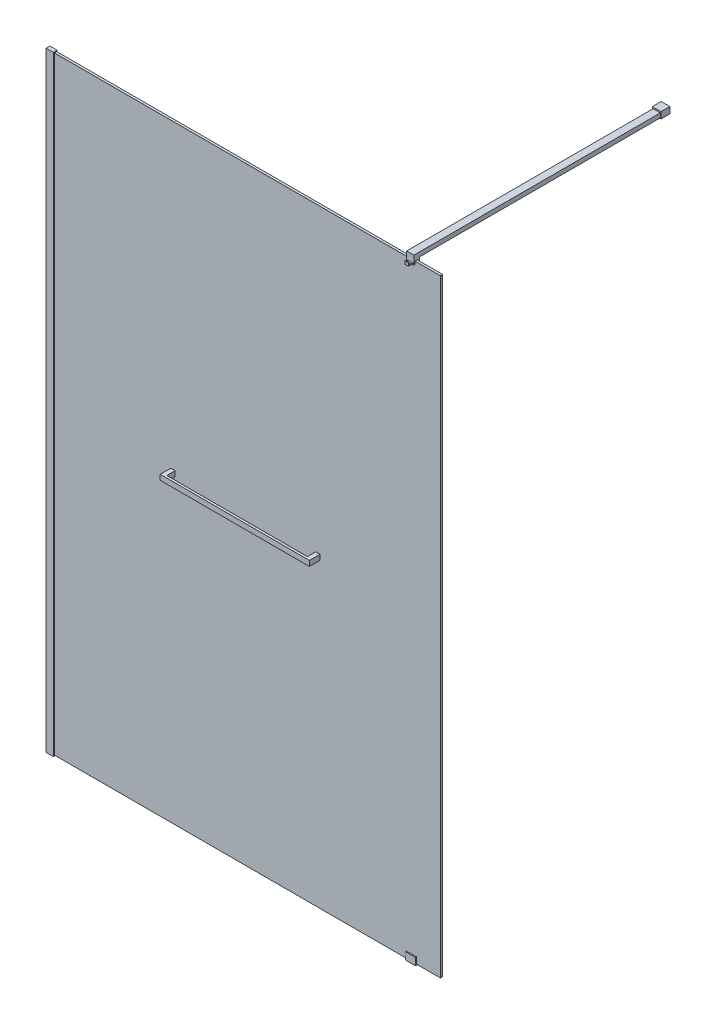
ISO-10303-21;
HEADER;
FILE_DESCRIPTION(('STEP AP214'),'2;1');
FILE_NAME('part.step','',(''),(''),'','','');
FILE_SCHEMA(('AUTOMOTIVE_DESIGN { 1 0 10303 214 1 1 1 1 }'));
ENDSEC;
DATA;
#1=APPLICATION_CONTEXT('core data for automotive mechanical design processes');
#2=APPLICATION_PROTOCOL_DEFINITION('international standard','automotive_design',2000,#1);
#3=PRODUCT_CONTEXT('',#1,'mechanical');
#4=PRODUCT('Part','Part','',(#3));
#5=PRODUCT_RELATED_PRODUCT_CATEGORY('part','',(#4));
#6=PRODUCT_DEFINITION_FORMATION('','',#4);
#7=PRODUCT_DEFINITION_CONTEXT('part definition',#1,'design');
#8=PRODUCT_DEFINITION('design','',#6,#7);
#9=PRODUCT_DEFINITION_SHAPE('','',#8);
#10=(LENGTH_UNIT() NAMED_UNIT(*) SI_UNIT(.MILLI.,.METRE.));
#11=(NAMED_UNIT(*) PLANE_ANGLE_UNIT() SI_UNIT($,.RADIAN.));
#12=(NAMED_UNIT(*) SI_UNIT($,.STERADIAN.) SOLID_ANGLE_UNIT());
#13=UNCERTAINTY_MEASURE_WITH_UNIT(LENGTH_MEASURE(1.E-05),#10,'distance_accuracy_value','');
#14=(GEOMETRIC_REPRESENTATION_CONTEXT(3) GLOBAL_UNCERTAINTY_ASSIGNED_CONTEXT((#13)) GLOBAL_UNIT_ASSIGNED_CONTEXT((#10,
#11,#12)) REPRESENTATION_CONTEXT('',''));
#15=CARTESIAN_POINT('',(0.,0.,0.));
#16=DIRECTION('',(0.,0.,1.));
#17=DIRECTION('',(1.,0.,0.));
#18=AXIS2_PLACEMENT_3D('',#15,#16,#17);
#19=CARTESIAN_POINT('',(942.45,1045.72,-21.6));
#20=DIRECTION('',(1.,0.,0.));
#21=DIRECTION('',(0.,0.,-1.));
#22=AXIS2_PLACEMENT_3D('',#19,#20,#21);
#23=PLANE('',#22);
#24=DIRECTION('',(0.,0.,-1.));
#25=VECTOR('',#24,1.);
#26=CARTESIAN_POINT('',(942.45,1053.72,-21.6));
#27=LINE('',#26,#25);
#28=CARTESIAN_POINT('',(942.45,1053.72,-21.6));
#29=VERTEX_POINT('',#28);
#30=CARTESIAN_POINT('',(942.45,1053.72,-101.6));
#31=VERTEX_POINT('',#30);
#32=EDGE_CURVE('E110',#29,#31,#27,.T.);
#33=ORIENTED_EDGE('',*,*,#32,.F.);
#34=DIRECTION('',(0.,1.,0.));
#35=VECTOR('',#34,1.);
#36=CARTESIAN_POINT('',(942.45,1045.72,-21.6));
#37=LINE('',#36,#35);
#38=CARTESIAN_POINT('',(942.45,1045.72,-21.6));
#39=VERTEX_POINT('',#38);
#40=EDGE_CURVE('E12',#39,#29,#37,.T.);
#41=ORIENTED_EDGE('',*,*,#40,.F.);
#42=DIRECTION('',(0.,0.,-1.));
#43=VECTOR('',#42,1.);
#44=CARTESIAN_POINT('',(942.45,1045.72,-21.6));
#45=LINE('',#44,#43);
#46=CARTESIAN_POINT('',(942.45,1045.72,-101.6));
#47=VERTEX_POINT('',#46);
#48=EDGE_CURVE('E104',#39,#47,#45,.T.);
#49=ORIENTED_EDGE('',*,*,#48,.T.);
#50=DIRECTION('',(0.,1.,0.));
#51=VECTOR('',#50,1.);
#52=CARTESIAN_POINT('',(942.45,1045.72,-101.6));
#53=LINE('',#52,#51);
#54=EDGE_CURVE('E49',#47,#31,#53,.T.);
#55=ORIENTED_EDGE('',*,*,#54,.T.);
#56=EDGE_LOOP('',(#33,#41,#49,#55));
#57=FACE_BOUND('',#56,.T.);
#58=ADVANCED_FACE('F46',(#57),#23,.T.);
#59=CARTESIAN_POINT('',(942.45,1045.72,-21.6));
#60=DIRECTION('',(0.,0.,1.));
#61=DIRECTION('',(1.,0.,0.));
#62=AXIS2_PLACEMENT_3D('',#59,#60,#61);
#63=PLANE('',#62);
#64=DIRECTION('',(1.,0.,0.));
#65=VECTOR('',#64,1.);
#66=CARTESIAN_POINT('',(942.45,1053.72,-21.6));
#67=LINE('',#66,#65);
#68=CARTESIAN_POINT('',(427.45,1053.72,-21.6));
#69=VERTEX_POINT('',#68);
#70=EDGE_CURVE('E106',#69,#29,#67,.T.);
#71=ORIENTED_EDGE('',*,*,#70,.F.);
#72=DIRECTION('',(0.,1.,0.));
#73=VECTOR('',#72,1.);
#74=CARTESIAN_POINT('',(427.45,1045.72,-21.6));
#75=LINE('',#74,#73);
#76=CARTESIAN_POINT('',(427.45,1045.72,-21.6));
#77=VERTEX_POINT('',#76);
#78=EDGE_CURVE('E55',#77,#69,#75,.T.);
#79=ORIENTED_EDGE('',*,*,#78,.F.);
#80=DIRECTION('',(1.,0.,0.));
#81=VECTOR('',#80,1.);
#82=CARTESIAN_POINT('',(942.45,1045.72,-21.6));
#83=LINE('',#82,#81);
#84=EDGE_CURVE('E101',#77,#39,#83,.T.);
#85=ORIENTED_EDGE('',*,*,#84,.T.);
#86=ORIENTED_EDGE('',*,*,#40,.T.);
#87=EDGE_LOOP('',(#71,#79,#85,#86));
#88=FACE_BOUND('',#87,.T.);
#89=ADVANCED_FACE('F120',(#88),#63,.T.);
#90=CARTESIAN_POINT('',(427.45,1045.72,-21.6));
#91=DIRECTION('',(-1.,0.,0.));
#92=DIRECTION('',(0.,0.,1.));
#93=AXIS2_PLACEMENT_3D('',#90,#91,#92);
#94=PLANE('',#93);
#95=DIRECTION('',(0.,0.,1.));
#96=VECTOR('',#95,1.);
#97=CARTESIAN_POINT('',(427.45,1053.72,-21.6));
#98=LINE('',#97,#96);
#99=CARTESIAN_POINT('',(427.45,1053.72,-101.6));
#100=VERTEX_POINT('',#99);
#101=EDGE_CURVE('E96',#100,#69,#98,.T.);
#102=ORIENTED_EDGE('',*,*,#101,.F.);
#103=DIRECTION('',(0.,1.,0.));
#104=VECTOR('',#103,1.);
#105=CARTESIAN_POINT('',(427.45,1045.72,-101.6));
#106=LINE('',#105,#104);
#107=CARTESIAN_POINT('',(427.45,1045.72,-101.6));
#108=VERTEX_POINT('',#107);
#109=EDGE_CURVE('E91',#108,#100,#106,.T.);
#110=ORIENTED_EDGE('',*,*,#109,.F.);
#111=DIRECTION('',(0.,0.,1.));
#112=VECTOR('',#111,1.);
#113=CARTESIAN_POINT('',(427.45,1045.72,-21.6));
#114=LINE('',#113,#112);
#115=EDGE_CURVE('E94',#108,#77,#114,.T.);
#116=ORIENTED_EDGE('',*,*,#115,.T.);
#117=ORIENTED_EDGE('',*,*,#78,.T.);
#118=EDGE_LOOP('',(#102,#110,#116,#117));
#119=FACE_BOUND('',#118,.T.);
#120=ADVANCED_FACE('F93',(#119),#94,.T.);
#121=CARTESIAN_POINT('',(942.45,1045.72,-101.6));
#122=DIRECTION('',(0.,0.,-1.));
#123=DIRECTION('',(-1.,0.,0.));
#124=AXIS2_PLACEMENT_3D('',#121,#122,#123);
#125=PLANE('',#124);
#126=DIRECTION('',(-1.,0.,0.));
#127=VECTOR('',#126,1.);
#128=CARTESIAN_POINT('',(942.45,1053.72,-101.6));
#129=LINE('',#128,#127);
#130=EDGE_CURVE('E113',#31,#100,#129,.T.);
#131=ORIENTED_EDGE('',*,*,#130,.F.);
#132=ORIENTED_EDGE('',*,*,#54,.F.);
#133=DIRECTION('',(-1.,0.,0.));
#134=VECTOR('',#133,1.);
#135=CARTESIAN_POINT('',(942.45,1045.72,-101.6));
#136=LINE('',#135,#134);
#137=EDGE_CURVE('E100',#47,#108,#136,.T.);
#138=ORIENTED_EDGE('',*,*,#137,.T.);
#139=ORIENTED_EDGE('',*,*,#109,.T.);
#140=EDGE_LOOP('',(#131,#132,#138,#139));
#141=FACE_BOUND('',#140,.T.);
#142=ADVANCED_FACE('F103',(#141),#125,.T.);
#143=CARTESIAN_POINT('',(942.45,1045.72,-101.6));
#144=DIRECTION('',(0.,1.,0.));
#145=DIRECTION('',(0.,0.,1.));
#146=AXIS2_PLACEMENT_3D('',#143,#144,#145);
#147=PLANE('',#146);
#148=ORIENTED_EDGE('',*,*,#48,.F.);
#149=ORIENTED_EDGE('',*,*,#84,.F.);
#150=ORIENTED_EDGE('',*,*,#115,.F.);
#151=ORIENTED_EDGE('',*,*,#137,.F.);
#152=EDGE_LOOP('',(#148,#149,#150,#151));
#153=FACE_BOUND('',#152,.T.);
#154=ADVANCED_FACE('F99',(#153),#147,.F.);
#155=CARTESIAN_POINT('',(942.45,1053.72,-101.6));
#156=DIRECTION('',(0.,1.,0.));
#157=DIRECTION('',(0.,0.,1.));
#158=AXIS2_PLACEMENT_3D('',#155,#156,#157);
#159=PLANE('',#158);
#160=ORIENTED_EDGE('',*,*,#32,.T.);
#161=ORIENTED_EDGE('',*,*,#130,.T.);
#162=ORIENTED_EDGE('',*,*,#101,.T.);
#163=ORIENTED_EDGE('',*,*,#70,.T.);
#164=EDGE_LOOP('',(#160,#161,#162,#163));
#165=FACE_BOUND('',#164,.T.);
#166=ADVANCED_FACE('F119',(#165),#159,.T.);
#167=CLOSED_SHELL('',(#58,#89,#120,#142,#154,#166));
#168=MANIFOLD_SOLID_BREP('B2',#167);
#169=CARTESIAN_POINT('',(442.45,1041.,-34.4));
#170=DIRECTION('',(0.,0.,1.));
#171=DIRECTION('',(1.,0.,0.));
#172=AXIS2_PLACEMENT_3D('',#169,#170,#171);
#173=PLANE('',#172);
#174=DIRECTION('',(0.,-1.,0.));
#175=VECTOR('',#174,1.);
#176=CARTESIAN_POINT('',(427.45,1059.,-34.4));
#177=LINE('',#176,#175);
#178=CARTESIAN_POINT('',(427.45,1045.73,-34.4));
#179=VERTEX_POINT('',#178);
#180=CARTESIAN_POINT('',(427.45,1041.,-34.4));
#181=VERTEX_POINT('',#180);
#182=EDGE_CURVE('E415',#179,#181,#177,.T.);
#183=ORIENTED_EDGE('',*,*,#182,.F.);
#184=DIRECTION('',(1.,0.,0.));
#185=VECTOR('',#184,1.);
#186=CARTESIAN_POINT('',(442.45,1045.73,-34.4));
#187=LINE('',#186,#185);
#188=CARTESIAN_POINT('',(442.45,1045.73,-34.4));
#189=VERTEX_POINT('',#188);
#190=EDGE_CURVE('E44',#179,#189,#187,.T.);
#191=ORIENTED_EDGE('',*,*,#190,.T.);
#192=DIRECTION('',(0.,1.,0.));
#193=VECTOR('',#192,1.);
#194=CARTESIAN_POINT('',(442.45,1059.,-34.4));
#195=LINE('',#194,#193);
#196=CARTESIAN_POINT('',(442.45,1041.,-34.4));
#197=VERTEX_POINT('',#196);
#198=EDGE_CURVE('E420',#197,#189,#195,.T.);
#199=ORIENTED_EDGE('',*,*,#198,.F.);
#200=DIRECTION('',(1.,0.,0.));
#201=VECTOR('',#200,1.);
#202=CARTESIAN_POINT('',(427.45,1041.,-34.4));
#203=LINE('',#202,#201);
#204=EDGE_CURVE('E394',#181,#197,#203,.T.);
#205=ORIENTED_EDGE('',*,*,#204,.F.);
#206=EDGE_LOOP('',(#183,#191,#199,#205));
#207=FACE_BOUND('',#206,.T.);
#208=ADVANCED_FACE('F180',(#207),#173,.F.);
#209=CARTESIAN_POINT('',(442.45,1059.,-34.4));
#210=DIRECTION('',(1.,0.,0.));
#211=DIRECTION('',(0.,0.,-1.));
#212=AXIS2_PLACEMENT_3D('',#209,#210,#211);
#213=PLANE('',#212);
#214=DIRECTION('',(0.,1.,0.));
#215=VECTOR('',#214,1.);
#216=CARTESIAN_POINT('',(442.45,1059.,25.1));
#217=LINE('',#216,#215);
#218=CARTESIAN_POINT('',(442.45,1041.,25.1));
#219=VERTEX_POINT('',#218);
#220=CARTESIAN_POINT('',(442.45,1059.,25.1));
#221=VERTEX_POINT('',#220);
#222=EDGE_CURVE('E198',#219,#221,#217,.T.);
#223=ORIENTED_EDGE('',*,*,#222,.F.);
#224=DIRECTION('',(0.,0.,1.));
#225=VECTOR('',#224,1.);
#226=CARTESIAN_POINT('',(442.45,1041.,-34.4));
#227=LINE('',#226,#225);
#228=EDGE_CURVE('E385',#197,#219,#227,.T.);
#229=ORIENTED_EDGE('',*,*,#228,.F.);
#230=ORIENTED_EDGE('',*,*,#198,.T.);
#231=DIRECTION('',(0.,0.,-1.));
#232=VECTOR('',#231,1.);
#233=CARTESIAN_POINT('',(442.45,1045.73,-34.4));
#234=LINE('',#233,#232);
#235=CARTESIAN_POINT('',(442.45,1045.73,-21.6));
#236=VERTEX_POINT('',#235);
#237=EDGE_CURVE('E433',#236,#189,#234,.T.);
#238=ORIENTED_EDGE('',*,*,#237,.F.);
#239=DIRECTION('',(0.,-1.,0.));
#240=VECTOR('',#239,1.);
#241=CARTESIAN_POINT('',(442.45,1059.,-21.6));
#242=LINE('',#241,#240);
#243=CARTESIAN_POINT('',(442.45,1053.73,-21.6));
#244=VERTEX_POINT('',#243);
#245=EDGE_CURVE('E431',#244,#236,#242,.T.);
#246=ORIENTED_EDGE('',*,*,#245,.F.);
#247=DIRECTION('',(0.,0.,1.));
#248=VECTOR('',#247,1.);
#249=CARTESIAN_POINT('',(442.45,1053.73,-34.4));
#250=LINE('',#249,#248);
#251=CARTESIAN_POINT('',(442.45,1053.73,-34.4));
#252=VERTEX_POINT('',#251);
#253=EDGE_CURVE('E435',#252,#244,#250,.T.);
#254=ORIENTED_EDGE('',*,*,#253,.F.);
#255=CARTESIAN_POINT('',(442.45,1059.,-34.4));
#256=VERTEX_POINT('',#255);
#257=EDGE_CURVE('E408',#252,#256,#195,.T.);
#258=ORIENTED_EDGE('',*,*,#257,.T.);
#259=DIRECTION('',(0.,0.,1.));
#260=VECTOR('',#259,1.);
#261=CARTESIAN_POINT('',(442.45,1059.,-34.4));
#262=LINE('',#261,#260);
#263=EDGE_CURVE('E389',#256,#221,#262,.T.);
#264=ORIENTED_EDGE('',*,*,#263,.T.);
#265=EDGE_LOOP('',(#223,#229,#230,#238,#246,#254,#258,#264));
#266=FACE_BOUND('',#265,.T.);
#267=ADVANCED_FACE('F182',(#266),#213,.T.);
#268=CARTESIAN_POINT('',(427.45,1041.,-34.4));
#269=DIRECTION('',(0.,-1.,0.));
#270=DIRECTION('',(0.,0.,-1.));
#271=AXIS2_PLACEMENT_3D('',#268,#269,#270);
#272=PLANE('',#271);
#273=ORIENTED_EDGE('',*,*,#228,.T.);
#274=DIRECTION('',(-1.,0.,0.));
#275=VECTOR('',#274,1.);
#276=CARTESIAN_POINT('',(947.147715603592,1041.,25.1));
#277=LINE('',#276,#275);
#278=CARTESIAN_POINT('',(927.45,1041.,25.1));
#279=VERTEX_POINT('',#278);
#280=EDGE_CURVE('E373',#279,#219,#277,.T.);
#281=ORIENTED_EDGE('',*,*,#280,.F.);
#282=DIRECTION('',(0.,0.,1.));
#283=VECTOR('',#282,1.);
#284=CARTESIAN_POINT('',(927.45,1041.,-34.4));
#285=LINE('',#284,#283);
#286=CARTESIAN_POINT('',(927.45,1041.,-34.4));
#287=VERTEX_POINT('',#286);
#288=EDGE_CURVE('E352',#287,#279,#285,.T.);
#289=ORIENTED_EDGE('',*,*,#288,.F.);
#290=DIRECTION('',(1.,0.,0.));
#291=VECTOR('',#290,1.);
#292=CARTESIAN_POINT('',(927.45,1041.,-34.4));
#293=LINE('',#292,#291);
#294=CARTESIAN_POINT('',(942.45,1041.,-34.4));
#295=VERTEX_POINT('',#294);
#296=EDGE_CURVE('E344',#287,#295,#293,.T.);
#297=ORIENTED_EDGE('',*,*,#296,.T.);
#298=DIRECTION('',(0.,0.,1.));
#299=VECTOR('',#298,1.);
#300=CARTESIAN_POINT('',(942.45,1041.,-34.4));
#301=LINE('',#300,#299);
#302=CARTESIAN_POINT('',(942.45,1041.,33.1));
#303=VERTEX_POINT('',#302);
#304=EDGE_CURVE('E348',#295,#303,#301,.T.);
#305=ORIENTED_EDGE('',*,*,#304,.T.);
#306=DIRECTION('',(1.,0.,0.));
#307=VECTOR('',#306,1.);
#308=CARTESIAN_POINT('',(427.45,1041.,33.1));
#309=LINE('',#308,#307);
#310=CARTESIAN_POINT('',(427.45,1041.,33.1));
#311=VERTEX_POINT('',#310);
#312=EDGE_CURVE('E423',#311,#303,#309,.T.);
#313=ORIENTED_EDGE('',*,*,#312,.F.);
#314=DIRECTION('',(0.,0.,1.));
#315=VECTOR('',#314,1.);
#316=CARTESIAN_POINT('',(427.45,1041.,-34.4));
#317=LINE('',#316,#315);
#318=EDGE_CURVE('E388',#181,#311,#317,.T.);
#319=ORIENTED_EDGE('',*,*,#318,.F.);
#320=ORIENTED_EDGE('',*,*,#204,.T.);
#321=EDGE_LOOP('',(#273,#281,#289,#297,#305,#313,#319,#320));
#322=FACE_BOUND('',#321,.T.);
#323=ADVANCED_FACE('F456',(#322),#272,.T.);
#324=CARTESIAN_POINT('',(427.45,1059.,-34.4));
#325=DIRECTION('',(-1.,0.,0.));
#326=DIRECTION('',(0.,0.,1.));
#327=AXIS2_PLACEMENT_3D('',#324,#325,#326);
#328=PLANE('',#327);
#329=DIRECTION('',(0.,0.,1.));
#330=VECTOR('',#329,1.);
#331=CARTESIAN_POINT('',(427.45,1045.73,-34.4));
#332=LINE('',#331,#330);
#333=CARTESIAN_POINT('',(427.45,1045.73,-21.6));
#334=VERTEX_POINT('',#333);
#335=EDGE_CURVE('E379',#179,#334,#332,.T.);
#336=ORIENTED_EDGE('',*,*,#335,.F.);
#337=ORIENTED_EDGE('',*,*,#182,.T.);
#338=ORIENTED_EDGE('',*,*,#318,.T.);
#339=DIRECTION('',(0.,-1.,0.));
#340=VECTOR('',#339,1.);
#341=CARTESIAN_POINT('',(427.45,1059.,33.1));
#342=LINE('',#341,#340);
#343=CARTESIAN_POINT('',(427.45,1059.,33.1));
#344=VERTEX_POINT('',#343);
#345=EDGE_CURVE('E425',#344,#311,#342,.T.);
#346=ORIENTED_EDGE('',*,*,#345,.F.);
#347=DIRECTION('',(0.,0.,1.));
#348=VECTOR('',#347,1.);
#349=CARTESIAN_POINT('',(427.45,1059.,-34.4));
#350=LINE('',#349,#348);
#351=CARTESIAN_POINT('',(427.45,1059.,-34.4));
#352=VERTEX_POINT('',#351);
#353=EDGE_CURVE('E397',#352,#344,#350,.T.);
#354=ORIENTED_EDGE('',*,*,#353,.F.);
#355=CARTESIAN_POINT('',(427.45,1053.73,-34.4));
#356=VERTEX_POINT('',#355);
#357=EDGE_CURVE('E406',#352,#356,#177,.T.);
#358=ORIENTED_EDGE('',*,*,#357,.T.);
#359=DIRECTION('',(0.,0.,-1.));
#360=VECTOR('',#359,1.);
#361=CARTESIAN_POINT('',(427.45,1053.73,-34.4));
#362=LINE('',#361,#360);
#363=CARTESIAN_POINT('',(427.45,1053.73,-21.6));
#364=VERTEX_POINT('',#363);
#365=EDGE_CURVE('E206',#364,#356,#362,.T.);
#366=ORIENTED_EDGE('',*,*,#365,.F.);
#367=DIRECTION('',(0.,1.,0.));
#368=VECTOR('',#367,1.);
#369=CARTESIAN_POINT('',(427.45,1053.73,-21.6));
#370=LINE('',#369,#368);
#371=EDGE_CURVE('E442',#334,#364,#370,.T.);
#372=ORIENTED_EDGE('',*,*,#371,.F.);
#373=EDGE_LOOP('',(#336,#337,#338,#346,#354,#358,#366,#372));
#374=FACE_BOUND('',#373,.T.);
#375=ADVANCED_FACE('F412',(#374),#328,.T.);
#376=CARTESIAN_POINT('',(427.45,1059.,-34.4));
#377=DIRECTION('',(0.,1.,0.));
#378=DIRECTION('',(0.,0.,1.));
#379=AXIS2_PLACEMENT_3D('',#376,#377,#378);
#380=PLANE('',#379);
#381=ORIENTED_EDGE('',*,*,#353,.T.);
#382=DIRECTION('',(-1.,0.,0.));
#383=VECTOR('',#382,1.);
#384=CARTESIAN_POINT('',(427.45,1059.,33.1));
#385=LINE('',#384,#383);
#386=CARTESIAN_POINT('',(942.45,1059.,33.1));
#387=VERTEX_POINT('',#386);
#388=EDGE_CURVE('E428',#387,#344,#385,.T.);
#389=ORIENTED_EDGE('',*,*,#388,.F.);
#390=DIRECTION('',(0.,0.,1.));
#391=VECTOR('',#390,1.);
#392=CARTESIAN_POINT('',(942.45,1059.,-34.4));
#393=LINE('',#392,#391);
#394=CARTESIAN_POINT('',(942.45,1059.,-34.4));
#395=VERTEX_POINT('',#394);
#396=EDGE_CURVE('E347',#395,#387,#393,.T.);
#397=ORIENTED_EDGE('',*,*,#396,.F.);
#398=DIRECTION('',(-1.,0.,0.));
#399=VECTOR('',#398,1.);
#400=CARTESIAN_POINT('',(927.45,1059.,-34.4));
#401=LINE('',#400,#399);
#402=CARTESIAN_POINT('',(927.45,1059.,-34.4));
#403=VERTEX_POINT('',#402);
#404=EDGE_CURVE('E337',#395,#403,#401,.T.);
#405=ORIENTED_EDGE('',*,*,#404,.T.);
#406=DIRECTION('',(0.,0.,1.));
#407=VECTOR('',#406,1.);
#408=CARTESIAN_POINT('',(927.45,1059.,-34.4));
#409=LINE('',#408,#407);
#410=CARTESIAN_POINT('',(927.45,1059.,25.1));
#411=VERTEX_POINT('',#410);
#412=EDGE_CURVE('E360',#403,#411,#409,.T.);
#413=ORIENTED_EDGE('',*,*,#412,.T.);
#414=DIRECTION('',(-1.,0.,0.));
#415=VECTOR('',#414,1.);
#416=CARTESIAN_POINT('',(947.147715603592,1059.,25.1));
#417=LINE('',#416,#415);
#418=EDGE_CURVE('E370',#411,#221,#417,.T.);
#419=ORIENTED_EDGE('',*,*,#418,.T.);
#420=ORIENTED_EDGE('',*,*,#263,.F.);
#421=DIRECTION('',(-1.,0.,0.));
#422=VECTOR('',#421,1.);
#423=CARTESIAN_POINT('',(427.45,1059.,-34.4));
#424=LINE('',#423,#422);
#425=EDGE_CURVE('E417',#256,#352,#424,.T.);
#426=ORIENTED_EDGE('',*,*,#425,.T.);
#427=EDGE_LOOP('',(#381,#389,#397,#405,#413,#419,#420,#426));
#428=FACE_BOUND('',#427,.T.);
#429=ADVANCED_FACE('F463',(#428),#380,.T.);
#430=ORIENTED_EDGE('',*,*,#257,.F.);
#431=DIRECTION('',(-1.,0.,0.));
#432=VECTOR('',#431,1.);
#433=CARTESIAN_POINT('',(442.45,1053.73,-34.4));
#434=LINE('',#433,#432);
#435=EDGE_CURVE('E190',#252,#356,#434,.T.);
#436=ORIENTED_EDGE('',*,*,#435,.T.);
#437=ORIENTED_EDGE('',*,*,#357,.F.);
#438=ORIENTED_EDGE('',*,*,#425,.F.);
#439=EDGE_LOOP('',(#430,#436,#437,#438));
#440=FACE_BOUND('',#439,.T.);
#441=ADVANCED_FACE('F404',(#440),#173,.F.);
#442=CARTESIAN_POINT('',(442.45,1041.,33.1));
#443=DIRECTION('',(0.,0.,1.));
#444=DIRECTION('',(1.,0.,0.));
#445=AXIS2_PLACEMENT_3D('',#442,#443,#444);
#446=PLANE('',#445);
#447=ORIENTED_EDGE('',*,*,#312,.T.);
#448=DIRECTION('',(0.,1.,0.));
#449=VECTOR('',#448,1.);
#450=CARTESIAN_POINT('',(942.45,1059.,33.1));
#451=LINE('',#450,#449);
#452=EDGE_CURVE('E332',#303,#387,#451,.T.);
#453=ORIENTED_EDGE('',*,*,#452,.T.);
#454=ORIENTED_EDGE('',*,*,#388,.T.);
#455=ORIENTED_EDGE('',*,*,#345,.T.);
#456=EDGE_LOOP('',(#447,#453,#454,#455));
#457=FACE_BOUND('',#456,.T.);
#458=ADVANCED_FACE('F459',(#457),#446,.T.);
#459=CARTESIAN_POINT('',(957.544369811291,1045.73,-34.4));
#460=DIRECTION('',(0.,-1.,0.));
#461=DIRECTION('',(0.,0.,-1.));
#462=AXIS2_PLACEMENT_3D('',#459,#460,#461);
#463=PLANE('',#462);
#464=ORIENTED_EDGE('',*,*,#237,.T.);
#465=ORIENTED_EDGE('',*,*,#190,.F.);
#466=ORIENTED_EDGE('',*,*,#335,.T.);
#467=DIRECTION('',(-1.,0.,0.));
#468=VECTOR('',#467,1.);
#469=CARTESIAN_POINT('',(957.544369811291,1045.73,-21.6));
#470=LINE('',#469,#468);
#471=EDGE_CURVE('E438',#236,#334,#470,.T.);
#472=ORIENTED_EDGE('',*,*,#471,.F.);
#473=EDGE_LOOP('',(#464,#465,#466,#472));
#474=FACE_BOUND('',#473,.T.);
#475=ADVANCED_FACE('F498',(#474),#463,.F.);
#476=CARTESIAN_POINT('',(957.544369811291,1053.73,-21.6));
#477=DIRECTION('',(0.,0.,1.));
#478=DIRECTION('',(1.,0.,0.));
#479=AXIS2_PLACEMENT_3D('',#476,#477,#478);
#480=PLANE('',#479);
#481=ORIENTED_EDGE('',*,*,#245,.T.);
#482=ORIENTED_EDGE('',*,*,#471,.T.);
#483=ORIENTED_EDGE('',*,*,#371,.T.);
#484=DIRECTION('',(-1.,0.,0.));
#485=VECTOR('',#484,1.);
#486=CARTESIAN_POINT('',(957.544369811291,1053.73,-21.6));
#487=LINE('',#486,#485);
#488=EDGE_CURVE('E437',#244,#364,#487,.T.);
#489=ORIENTED_EDGE('',*,*,#488,.F.);
#490=EDGE_LOOP('',(#481,#482,#483,#489));
#491=FACE_BOUND('',#490,.T.);
#492=ADVANCED_FACE('F446',(#491),#480,.F.);
#493=CARTESIAN_POINT('',(957.544369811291,1053.73,-34.4));
#494=DIRECTION('',(0.,1.,0.));
#495=DIRECTION('',(0.,0.,1.));
#496=AXIS2_PLACEMENT_3D('',#493,#494,#495);
#497=PLANE('',#496);
#498=ORIENTED_EDGE('',*,*,#253,.T.);
#499=ORIENTED_EDGE('',*,*,#488,.T.);
#500=ORIENTED_EDGE('',*,*,#365,.T.);
#501=ORIENTED_EDGE('',*,*,#435,.F.);
#502=EDGE_LOOP('',(#498,#499,#500,#501));
#503=FACE_BOUND('',#502,.T.);
#504=ADVANCED_FACE('F538',(#503),#497,.F.);
#505=CARTESIAN_POINT('',(947.147715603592,1059.,25.1));
#506=DIRECTION('',(0.,0.,1.));
#507=DIRECTION('',(0.,-1.,0.));
#508=AXIS2_PLACEMENT_3D('',#505,#506,#507);
#509=PLANE('',#508);
#510=ORIENTED_EDGE('',*,*,#418,.F.);
#511=DIRECTION('',(0.,-1.,0.));
#512=VECTOR('',#511,1.);
#513=CARTESIAN_POINT('',(927.45,1059.,25.1));
#514=LINE('',#513,#512);
#515=EDGE_CURVE('E184',#411,#279,#514,.T.);
#516=ORIENTED_EDGE('',*,*,#515,.T.);
#517=ORIENTED_EDGE('',*,*,#280,.T.);
#518=ORIENTED_EDGE('',*,*,#222,.T.);
#519=EDGE_LOOP('',(#510,#516,#517,#518));
#520=FACE_BOUND('',#519,.T.);
#521=ADVANCED_FACE('F470',(#520),#509,.F.);
#522=CARTESIAN_POINT('',(927.45,1059.,-34.4));
#523=DIRECTION('',(-1.,0.,0.));
#524=DIRECTION('',(0.,0.,1.));
#525=AXIS2_PLACEMENT_3D('',#522,#523,#524);
#526=PLANE('',#525);
#527=ORIENTED_EDGE('',*,*,#515,.F.);
#528=ORIENTED_EDGE('',*,*,#412,.F.);
#529=DIRECTION('',(0.,-1.,0.));
#530=VECTOR('',#529,1.);
#531=CARTESIAN_POINT('',(927.45,1059.,-34.4));
#532=LINE('',#531,#530);
#533=CARTESIAN_POINT('',(927.45,1053.73,-34.4));
#534=VERTEX_POINT('',#533);
#535=EDGE_CURVE('E341',#403,#534,#532,.T.);
#536=ORIENTED_EDGE('',*,*,#535,.T.);
#537=DIRECTION('',(0.,0.,-1.));
#538=VECTOR('',#537,1.);
#539=CARTESIAN_POINT('',(927.45,1053.73,-34.4));
#540=LINE('',#539,#538);
#541=CARTESIAN_POINT('',(927.45,1053.73,-21.6));
#542=VERTEX_POINT('',#541);
#543=EDGE_CURVE('E329',#542,#534,#540,.T.);
#544=ORIENTED_EDGE('',*,*,#543,.F.);
#545=DIRECTION('',(0.,1.,0.));
#546=VECTOR('',#545,1.);
#547=CARTESIAN_POINT('',(927.45,1059.,-21.6));
#548=LINE('',#547,#546);
#549=CARTESIAN_POINT('',(927.45,1045.73,-21.6));
#550=VERTEX_POINT('',#549);
#551=EDGE_CURVE('E351',#550,#542,#548,.T.);
#552=ORIENTED_EDGE('',*,*,#551,.F.);
#553=DIRECTION('',(0.,0.,1.));
#554=VECTOR('',#553,1.);
#555=CARTESIAN_POINT('',(927.45,1045.73,-34.4));
#556=LINE('',#555,#554);
#557=CARTESIAN_POINT('',(927.45,1045.73,-34.4));
#558=VERTEX_POINT('',#557);
#559=EDGE_CURVE('E313',#558,#550,#556,.T.);
#560=ORIENTED_EDGE('',*,*,#559,.F.);
#561=EDGE_CURVE('E340',#558,#287,#532,.T.);
#562=ORIENTED_EDGE('',*,*,#561,.T.);
#563=ORIENTED_EDGE('',*,*,#288,.T.);
#564=EDGE_LOOP('',(#527,#528,#536,#544,#552,#560,#562,#563));
#565=FACE_BOUND('',#564,.T.);
#566=ADVANCED_FACE('F471',(#565),#526,.T.);
#567=CARTESIAN_POINT('',(942.45,1041.,-34.4));
#568=DIRECTION('',(0.,0.,1.));
#569=DIRECTION('',(1.,0.,0.));
#570=AXIS2_PLACEMENT_3D('',#567,#568,#569);
#571=PLANE('',#570);
#572=ORIENTED_EDGE('',*,*,#561,.F.);
#573=DIRECTION('',(-1.,0.,0.));
#574=VECTOR('',#573,1.);
#575=CARTESIAN_POINT('',(957.544369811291,1045.73,-34.4));
#576=LINE('',#575,#574);
#577=CARTESIAN_POINT('',(942.45,1045.73,-34.4));
#578=VERTEX_POINT('',#577);
#579=EDGE_CURVE('E326',#578,#558,#576,.T.);
#580=ORIENTED_EDGE('',*,*,#579,.F.);
#581=DIRECTION('',(0.,1.,0.));
#582=VECTOR('',#581,1.);
#583=CARTESIAN_POINT('',(942.45,1059.,-34.4));
#584=LINE('',#583,#582);
#585=EDGE_CURVE('E318',#295,#578,#584,.T.);
#586=ORIENTED_EDGE('',*,*,#585,.F.);
#587=ORIENTED_EDGE('',*,*,#296,.F.);
#588=EDGE_LOOP('',(#572,#580,#586,#587));
#589=FACE_BOUND('',#588,.T.);
#590=ADVANCED_FACE('F476',(#589),#571,.F.);
#591=CARTESIAN_POINT('',(942.45,1059.,-34.4));
#592=DIRECTION('',(1.,0.,0.));
#593=DIRECTION('',(0.,0.,-1.));
#594=AXIS2_PLACEMENT_3D('',#591,#592,#593);
#595=PLANE('',#594);
#596=DIRECTION('',(0.,0.,1.));
#597=VECTOR('',#596,1.);
#598=CARTESIAN_POINT('',(942.45,1045.73,-34.4));
#599=LINE('',#598,#597);
#600=CARTESIAN_POINT('',(942.45,1045.73,-21.6));
#601=VERTEX_POINT('',#600);
#602=EDGE_CURVE('E310',#578,#601,#599,.T.);
#603=ORIENTED_EDGE('',*,*,#602,.T.);
#604=DIRECTION('',(0.,1.,0.));
#605=VECTOR('',#604,1.);
#606=CARTESIAN_POINT('',(942.45,1053.73,-21.6));
#607=LINE('',#606,#605);
#608=CARTESIAN_POINT('',(942.45,1053.73,-21.6));
#609=VERTEX_POINT('',#608);
#610=EDGE_CURVE('E297',#601,#609,#607,.T.);
#611=ORIENTED_EDGE('',*,*,#610,.T.);
#612=DIRECTION('',(0.,0.,-1.));
#613=VECTOR('',#612,1.);
#614=CARTESIAN_POINT('',(942.45,1053.73,-34.4));
#615=LINE('',#614,#613);
#616=CARTESIAN_POINT('',(942.45,1053.73,-34.4));
#617=VERTEX_POINT('',#616);
#618=EDGE_CURVE('E321',#609,#617,#615,.T.);
#619=ORIENTED_EDGE('',*,*,#618,.T.);
#620=EDGE_CURVE('E335',#617,#395,#584,.T.);
#621=ORIENTED_EDGE('',*,*,#620,.T.);
#622=ORIENTED_EDGE('',*,*,#396,.T.);
#623=ORIENTED_EDGE('',*,*,#452,.F.);
#624=ORIENTED_EDGE('',*,*,#304,.F.);
#625=ORIENTED_EDGE('',*,*,#585,.T.);
#626=EDGE_LOOP('',(#603,#611,#619,#621,#622,#623,#624,#625));
#627=FACE_BOUND('',#626,.T.);
#628=ADVANCED_FACE('F316',(#627),#595,.T.);
#629=ORIENTED_EDGE('',*,*,#620,.F.);
#630=DIRECTION('',(-1.,0.,0.));
#631=VECTOR('',#630,1.);
#632=CARTESIAN_POINT('',(957.544369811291,1053.73,-34.4));
#633=LINE('',#632,#631);
#634=EDGE_CURVE('E322',#617,#534,#633,.T.);
#635=ORIENTED_EDGE('',*,*,#634,.T.);
#636=ORIENTED_EDGE('',*,*,#535,.F.);
#637=ORIENTED_EDGE('',*,*,#404,.F.);
#638=EDGE_LOOP('',(#629,#635,#636,#637));
#639=FACE_BOUND('',#638,.T.);
#640=ADVANCED_FACE('F467',(#639),#571,.F.);
#641=CARTESIAN_POINT('',(957.544369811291,1045.73,-34.4));
#642=DIRECTION('',(0.,-1.,0.));
#643=DIRECTION('',(0.,0.,-1.));
#644=AXIS2_PLACEMENT_3D('',#641,#642,#643);
#645=PLANE('',#644);
#646=ORIENTED_EDGE('',*,*,#559,.T.);
#647=DIRECTION('',(-1.,0.,0.));
#648=VECTOR('',#647,1.);
#649=CARTESIAN_POINT('',(957.544369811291,1045.73,-21.6));
#650=LINE('',#649,#648);
#651=EDGE_CURVE('E300',#601,#550,#650,.T.);
#652=ORIENTED_EDGE('',*,*,#651,.F.);
#653=ORIENTED_EDGE('',*,*,#602,.F.);
#654=ORIENTED_EDGE('',*,*,#579,.T.);
#655=EDGE_LOOP('',(#646,#652,#653,#654));
#656=FACE_BOUND('',#655,.T.);
#657=ADVANCED_FACE('F309',(#656),#645,.F.);
#658=CARTESIAN_POINT('',(957.544369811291,1053.73,-21.6));
#659=DIRECTION('',(0.,0.,1.));
#660=DIRECTION('',(1.,0.,0.));
#661=AXIS2_PLACEMENT_3D('',#658,#659,#660);
#662=PLANE('',#661);
#663=ORIENTED_EDGE('',*,*,#551,.T.);
#664=DIRECTION('',(-1.,0.,0.));
#665=VECTOR('',#664,1.);
#666=CARTESIAN_POINT('',(957.544369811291,1053.73,-21.6));
#667=LINE('',#666,#665);
#668=EDGE_CURVE('E303',#609,#542,#667,.T.);
#669=ORIENTED_EDGE('',*,*,#668,.F.);
#670=ORIENTED_EDGE('',*,*,#610,.F.);
#671=ORIENTED_EDGE('',*,*,#651,.T.);
#672=EDGE_LOOP('',(#663,#669,#670,#671));
#673=FACE_BOUND('',#672,.T.);
#674=ADVANCED_FACE('F299',(#673),#662,.F.);
#675=CARTESIAN_POINT('',(957.544369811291,1053.73,-34.4));
#676=DIRECTION('',(0.,1.,0.));
#677=DIRECTION('',(0.,0.,1.));
#678=AXIS2_PLACEMENT_3D('',#675,#676,#677);
#679=PLANE('',#678);
#680=ORIENTED_EDGE('',*,*,#543,.T.);
#681=ORIENTED_EDGE('',*,*,#634,.F.);
#682=ORIENTED_EDGE('',*,*,#618,.F.);
#683=ORIENTED_EDGE('',*,*,#668,.T.);
#684=EDGE_LOOP('',(#680,#681,#682,#683));
#685=FACE_BOUND('',#684,.T.);
#686=ADVANCED_FACE('F479',(#685),#679,.F.);
#687=CLOSED_SHELL('',(#208,#267,#323,#375,#429,#441,#458,#475,#492,#504,#521,#566,#590,#628,
#640,#657,#674,#686));
#688=MANIFOLD_SOLID_BREP('B6',#687);
#689=CARTESIAN_POINT('',(1270.95,2090.,-19.4000000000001));
#690=DIRECTION('',(-1.,0.,0.));
#691=DIRECTION('',(0.,0.,1.));
#692=AXIS2_PLACEMENT_3D('',#689,#690,#691);
#693=PLANE('',#692);
#694=DIRECTION('',(0.,-1.,0.));
#695=VECTOR('',#694,1.);
#696=CARTESIAN_POINT('',(1270.95,2090.,-850.03));
#697=LINE('',#696,#695);
#698=CARTESIAN_POINT('',(1270.95,2120.,-850.03));
#699=VERTEX_POINT('',#698);
#700=CARTESIAN_POINT('',(1270.95,2105.,-850.03));
#701=VERTEX_POINT('',#700);
#702=EDGE_CURVE('E669',#699,#701,#697,.T.);
#703=ORIENTED_EDGE('',*,*,#702,.F.);
#704=DIRECTION('',(0.,0.,1.));
#705=VECTOR('',#704,1.);
#706=CARTESIAN_POINT('',(1270.95,2120.,0.599999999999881));
#707=LINE('',#706,#705);
#708=CARTESIAN_POINT('',(1270.95,2120.,0.599999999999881));
#709=VERTEX_POINT('',#708);
#710=EDGE_CURVE('E994',#699,#709,#707,.T.);
#711=ORIENTED_EDGE('',*,*,#710,.T.);
#712=DIRECTION('',(0.,-1.,0.));
#713=VECTOR('',#712,1.);
#714=CARTESIAN_POINT('',(1270.95,2094.,0.599999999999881));
#715=LINE('',#714,#713);
#716=CARTESIAN_POINT('',(1270.95,2094.,0.599999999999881));
#717=VERTEX_POINT('',#716);
#718=EDGE_CURVE('E996',#709,#717,#715,.T.);
#719=ORIENTED_EDGE('',*,*,#718,.T.);
#720=DIRECTION('',(0.,1.,0.));
#721=VECTOR('',#720,1.);
#722=CARTESIAN_POINT('',(1270.95,2090.,0.599999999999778));
#723=LINE('',#722,#721);
#724=CARTESIAN_POINT('',(1270.95,2090.,0.599999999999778));
#725=VERTEX_POINT('',#724);
#726=EDGE_CURVE('E940',#725,#717,#723,.T.);
#727=ORIENTED_EDGE('',*,*,#726,.F.);
#728=DIRECTION('',(0.,0.,-1.));
#729=VECTOR('',#728,1.);
#730=CARTESIAN_POINT('',(1270.95,2090.,-3.40000000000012));
#731=LINE('',#730,#729);
#732=CARTESIAN_POINT('',(1270.95,2090.,-3.40000000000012));
#733=VERTEX_POINT('',#732);
#734=EDGE_CURVE('E970',#725,#733,#731,.T.);
#735=ORIENTED_EDGE('',*,*,#734,.T.);
#736=DIRECTION('',(0.,1.,-1.30407837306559E-13));
#737=VECTOR('',#736,1.);
#738=CARTESIAN_POINT('',(1270.95,2100.,-3.40000000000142));
#739=LINE('',#738,#737);
#740=CARTESIAN_POINT('',(1270.95,2100.,-3.40000000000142));
#741=VERTEX_POINT('',#740);
#742=EDGE_CURVE('E1000',#733,#741,#739,.T.);
#743=ORIENTED_EDGE('',*,*,#742,.T.);
#744=DIRECTION('',(0.,0.,-1.));
#745=VECTOR('',#744,1.);
#746=CARTESIAN_POINT('',(1270.95,2100.,-11.4000000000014));
#747=LINE('',#746,#745);
#748=CARTESIAN_POINT('',(1270.95,2100.,-11.4000000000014));
#749=VERTEX_POINT('',#748);
#750=EDGE_CURVE('E1002',#741,#749,#747,.T.);
#751=ORIENTED_EDGE('',*,*,#750,.T.);
#752=DIRECTION('',(0.,-1.,1.30451205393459E-13));
#753=VECTOR('',#752,1.);
#754=CARTESIAN_POINT('',(1270.95,2090.,-11.4000000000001));
#755=LINE('',#754,#753);
#756=CARTESIAN_POINT('',(1270.95,2090.,-11.4000000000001));
#757=VERTEX_POINT('',#756);
#758=EDGE_CURVE('E1003',#749,#757,#755,.T.);
#759=ORIENTED_EDGE('',*,*,#758,.T.);
#760=DIRECTION('',(0.,0.,-1.));
#761=VECTOR('',#760,1.);
#762=CARTESIAN_POINT('',(1270.95,2090.,-19.4000000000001));
#763=LINE('',#762,#761);
#764=CARTESIAN_POINT('',(1270.95,2090.,-19.4000000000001));
#765=VERTEX_POINT('',#764);
#766=EDGE_CURVE('E891',#757,#765,#763,.T.);
#767=ORIENTED_EDGE('',*,*,#766,.T.);
#768=DIRECTION('',(0.,1.,0.));
#769=VECTOR('',#768,1.);
#770=CARTESIAN_POINT('',(1270.95,2120.,-19.4000000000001));
#771=LINE('',#770,#769);
#772=CARTESIAN_POINT('',(1270.95,2105.,-19.4000000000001));
#773=VERTEX_POINT('',#772);
#774=EDGE_CURVE('E857',#765,#773,#771,.T.);
#775=ORIENTED_EDGE('',*,*,#774,.T.);
#776=DIRECTION('',(0.,0.,-1.));
#777=VECTOR('',#776,1.);
#778=CARTESIAN_POINT('',(1270.95,2105.,-881.03));
#779=LINE('',#778,#777);
#780=EDGE_CURVE('E856',#773,#701,#779,.T.);
#781=ORIENTED_EDGE('',*,*,#780,.T.);
#782=EDGE_LOOP('',(#703,#711,#719,#727,#735,#743,#751,#759,#767,#775,#781));
#783=FACE_BOUND('',#782,.T.);
#784=ADVANCED_FACE('F654',(#783),#693,.F.);
#785=CARTESIAN_POINT('',(1245.95,2090.,-19.4000000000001));
#786=DIRECTION('',(-1.,0.,0.));
#787=DIRECTION('',(0.,0.,1.));
#788=AXIS2_PLACEMENT_3D('',#785,#786,#787);
#789=PLANE('',#788);
#790=DIRECTION('',(0.,0.,1.));
#791=VECTOR('',#790,1.);
#792=CARTESIAN_POINT('',(1245.95,2120.,0.599999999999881));
#793=LINE('',#792,#791);
#794=CARTESIAN_POINT('',(1245.95,2120.,-850.03));
#795=VERTEX_POINT('',#794);
#796=CARTESIAN_POINT('',(1245.95,2120.,0.599999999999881));
#797=VERTEX_POINT('',#796);
#798=EDGE_CURVE('E880',#795,#797,#793,.T.);
#799=ORIENTED_EDGE('',*,*,#798,.F.);
#800=DIRECTION('',(0.,-1.,0.));
#801=VECTOR('',#800,1.);
#802=CARTESIAN_POINT('',(1245.95,2090.,-850.03));
#803=LINE('',#802,#801);
#804=CARTESIAN_POINT('',(1245.95,2105.,-850.03));
#805=VERTEX_POINT('',#804);
#806=EDGE_CURVE('E838',#795,#805,#803,.T.);
#807=ORIENTED_EDGE('',*,*,#806,.T.);
#808=DIRECTION('',(0.,0.,1.));
#809=VECTOR('',#808,1.);
#810=CARTESIAN_POINT('',(1245.95,2105.,-881.03));
#811=LINE('',#810,#809);
#812=CARTESIAN_POINT('',(1245.95,2105.,-19.4000000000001));
#813=VERTEX_POINT('',#812);
#814=EDGE_CURVE('E846',#805,#813,#811,.T.);
#815=ORIENTED_EDGE('',*,*,#814,.T.);
#816=DIRECTION('',(0.,1.,0.));
#817=VECTOR('',#816,1.);
#818=CARTESIAN_POINT('',(1245.95,2120.,-19.4000000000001));
#819=LINE('',#818,#817);
#820=CARTESIAN_POINT('',(1245.95,2090.,-19.4000000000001));
#821=VERTEX_POINT('',#820);
#822=EDGE_CURVE('E870',#821,#813,#819,.T.);
#823=ORIENTED_EDGE('',*,*,#822,.F.);
#824=DIRECTION('',(0.,0.,-1.));
#825=VECTOR('',#824,1.);
#826=CARTESIAN_POINT('',(1245.95,2090.,-19.4000000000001));
#827=LINE('',#826,#825);
#828=CARTESIAN_POINT('',(1245.95,2090.,-11.4000000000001));
#829=VERTEX_POINT('',#828);
#830=EDGE_CURVE('E904',#829,#821,#827,.T.);
#831=ORIENTED_EDGE('',*,*,#830,.F.);
#832=DIRECTION('',(0.,-1.,1.30451205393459E-13));
#833=VECTOR('',#832,1.);
#834=CARTESIAN_POINT('',(1245.95,2090.,-11.4000000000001));
#835=LINE('',#834,#833);
#836=CARTESIAN_POINT('',(1245.95,2100.,-11.4000000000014));
#837=VERTEX_POINT('',#836);
#838=EDGE_CURVE('E902',#837,#829,#835,.T.);
#839=ORIENTED_EDGE('',*,*,#838,.F.);
#840=DIRECTION('',(0.,0.,-1.));
#841=VECTOR('',#840,1.);
#842=CARTESIAN_POINT('',(1245.95,2100.,-11.4000000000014));
#843=LINE('',#842,#841);
#844=CARTESIAN_POINT('',(1245.95,2100.,-3.40000000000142));
#845=VERTEX_POINT('',#844);
#846=EDGE_CURVE('E900',#845,#837,#843,.T.);
#847=ORIENTED_EDGE('',*,*,#846,.F.);
#848=DIRECTION('',(0.,1.,-1.30407837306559E-13));
#849=VECTOR('',#848,1.);
#850=CARTESIAN_POINT('',(1245.95,2100.,-3.40000000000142));
#851=LINE('',#850,#849);
#852=CARTESIAN_POINT('',(1245.95,2090.,-3.40000000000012));
#853=VERTEX_POINT('',#852);
#854=EDGE_CURVE('E898',#853,#845,#851,.T.);
#855=ORIENTED_EDGE('',*,*,#854,.F.);
#856=DIRECTION('',(0.,0.,-1.));
#857=VECTOR('',#856,1.);
#858=CARTESIAN_POINT('',(1245.95,2090.,-3.40000000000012));
#859=LINE('',#858,#857);
#860=CARTESIAN_POINT('',(1245.95,2090.,0.599999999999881));
#861=VERTEX_POINT('',#860);
#862=EDGE_CURVE('E896',#861,#853,#859,.T.);
#863=ORIENTED_EDGE('',*,*,#862,.F.);
#864=DIRECTION('',(0.,1.,0.));
#865=VECTOR('',#864,1.);
#866=CARTESIAN_POINT('',(1245.95,2090.,0.599999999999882));
#867=LINE('',#866,#865);
#868=CARTESIAN_POINT('',(1245.95,2094.,0.599999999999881));
#869=VERTEX_POINT('',#868);
#870=EDGE_CURVE('E937',#861,#869,#867,.T.);
#871=ORIENTED_EDGE('',*,*,#870,.T.);
#872=DIRECTION('',(0.,-1.,0.));
#873=VECTOR('',#872,1.);
#874=CARTESIAN_POINT('',(1245.95,2094.,0.599999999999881));
#875=LINE('',#874,#873);
#876=EDGE_CURVE('E882',#797,#869,#875,.T.);
#877=ORIENTED_EDGE('',*,*,#876,.F.);
#878=EDGE_LOOP('',(#799,#807,#815,#823,#831,#839,#847,#855,#863,#871,#877));
#879=FACE_BOUND('',#878,.T.);
#880=ADVANCED_FACE('F867',(#879),#789,.T.);
#881=CARTESIAN_POINT('',(1270.95,2120.,0.599999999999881));
#882=DIRECTION('',(0.,-1.,0.));
#883=DIRECTION('',(0.,0.,-1.));
#884=AXIS2_PLACEMENT_3D('',#881,#882,#883);
#885=PLANE('',#884);
#886=DIRECTION('',(1.,0.,0.));
#887=VECTOR('',#886,1.);
#888=CARTESIAN_POINT('',(1270.95,2120.,-850.03));
#889=LINE('',#888,#887);
#890=EDGE_CURVE('E676',#795,#699,#889,.T.);
#891=ORIENTED_EDGE('',*,*,#890,.F.);
#892=ORIENTED_EDGE('',*,*,#798,.T.);
#893=DIRECTION('',(-1.,0.,0.));
#894=VECTOR('',#893,1.);
#895=CARTESIAN_POINT('',(1270.95,2120.,0.599999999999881));
#896=LINE('',#895,#894);
#897=EDGE_CURVE('E934',#709,#797,#896,.T.);
#898=ORIENTED_EDGE('',*,*,#897,.F.);
#899=ORIENTED_EDGE('',*,*,#710,.F.);
#900=EDGE_LOOP('',(#891,#892,#898,#899));
#901=FACE_BOUND('',#900,.T.);
#902=ADVANCED_FACE('F1045',(#901),#885,.F.);
#903=CARTESIAN_POINT('',(1245.95,2105.,-19.4000000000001));
#904=DIRECTION('',(0.,1.,0.));
#905=DIRECTION('',(0.,0.,1.));
#906=AXIS2_PLACEMENT_3D('',#903,#904,#905);
#907=PLANE('',#906);
#908=DIRECTION('',(-1.,0.,0.));
#909=VECTOR('',#908,1.);
#910=CARTESIAN_POINT('',(1245.95,2105.,-850.03));
#911=LINE('',#910,#909);
#912=EDGE_CURVE('E178',#701,#805,#911,.T.);
#913=ORIENTED_EDGE('',*,*,#912,.F.);
#914=ORIENTED_EDGE('',*,*,#780,.F.);
#915=DIRECTION('',(1.,0.,0.));
#916=VECTOR('',#915,1.);
#917=CARTESIAN_POINT('',(1245.95,2105.,-19.4000000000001));
#918=LINE('',#917,#916);
#919=EDGE_CURVE('E852',#813,#773,#918,.T.);
#920=ORIENTED_EDGE('',*,*,#919,.F.);
#921=ORIENTED_EDGE('',*,*,#814,.F.);
#922=EDGE_LOOP('',(#913,#914,#920,#921));
#923=FACE_BOUND('',#922,.T.);
#924=ADVANCED_FACE('F873',(#923),#907,.F.);
#925=CARTESIAN_POINT('',(1270.95,2094.,9.84506801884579));
#926=DIRECTION('',(0.,-1.,0.));
#927=DIRECTION('',(0.,0.,-1.));
#928=AXIS2_PLACEMENT_3D('',#925,#926,#927);
#929=PLANE('',#928);
#930=DIRECTION('',(-0.906307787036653,0.,-0.422618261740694));
#931=VECTOR('',#930,1.);
#932=CARTESIAN_POINT('',(1270.02591161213,2094.,11.8267819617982));
#933=LINE('',#932,#931);
#934=CARTESIAN_POINT('',(1252.45,2094.,3.6309997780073));
#935=VERTEX_POINT('',#934);
#936=EDGE_CURVE('E973',#935,#869,#933,.T.);
#937=ORIENTED_EDGE('',*,*,#936,.F.);
#938=DIRECTION('',(0.,0.,-1.));
#939=VECTOR('',#938,1.);
#940=CARTESIAN_POINT('',(1252.45,2094.,9.84506801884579));
#941=LINE('',#940,#939);
#942=CARTESIAN_POINT('',(1252.45,2094.,9.84506801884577));
#943=VERTEX_POINT('',#942);
#944=EDGE_CURVE('E881',#943,#935,#941,.T.);
#945=ORIENTED_EDGE('',*,*,#944,.F.);
#946=DIRECTION('',(-1.,0.,0.));
#947=VECTOR('',#946,1.);
#948=CARTESIAN_POINT('',(1270.95,2094.,9.84506801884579));
#949=LINE('',#948,#947);
#950=CARTESIAN_POINT('',(1264.45,2094.,9.84506801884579));
#951=VERTEX_POINT('',#950);
#952=EDGE_CURVE('E928',#951,#943,#949,.T.);
#953=ORIENTED_EDGE('',*,*,#952,.F.);
#954=DIRECTION('',(0.,0.,1.));
#955=VECTOR('',#954,1.);
#956=CARTESIAN_POINT('',(1264.45,2094.,9.84506801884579));
#957=LINE('',#956,#955);
#958=CARTESIAN_POINT('',(1264.45,2094.,3.63099977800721));
#959=VERTEX_POINT('',#958);
#960=EDGE_CURVE('E987',#959,#951,#957,.T.);
#961=ORIENTED_EDGE('',*,*,#960,.F.);
#962=DIRECTION('',(-0.906307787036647,0.,0.422618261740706));
#963=VECTOR('',#962,1.);
#964=CARTESIAN_POINT('',(1267.40893350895,2094.,2.25122642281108));
#965=LINE('',#964,#963);
#966=EDGE_CURVE('E972',#717,#959,#965,.T.);
#967=ORIENTED_EDGE('',*,*,#966,.F.);
#968=DIRECTION('',(-1.,0.,0.));
#969=VECTOR('',#968,1.);
#970=CARTESIAN_POINT('',(1270.95,2094.,0.599999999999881));
#971=LINE('',#970,#969);
#972=EDGE_CURVE('E931',#717,#869,#971,.T.);
#973=ORIENTED_EDGE('',*,*,#972,.T.);
#974=EDGE_LOOP('',(#937,#945,#953,#961,#967,#973));
#975=FACE_BOUND('',#974,.T.);
#976=ADVANCED_FACE('F1032',(#975),#929,.F.);
#977=CARTESIAN_POINT('',(1270.95,2100.,10.3700000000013));
#978=DIRECTION('',(0.,-0.087155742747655,0.996194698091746));
#979=DIRECTION('',(0.,-0.996194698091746,-0.087155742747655));
#980=AXIS2_PLACEMENT_3D('',#977,#978,#979);
#981=PLANE('',#980);
#982=DIRECTION('',(0.,-0.996194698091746,-0.087155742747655));
#983=VECTOR('',#982,1.);
#984=CARTESIAN_POINT('',(1252.45,2100.,10.3700000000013));
#985=LINE('',#984,#983);
#986=CARTESIAN_POINT('',(1252.45,2100.,10.3700000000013));
#987=VERTEX_POINT('',#986);
#988=EDGE_CURVE('E884',#987,#943,#985,.T.);
#989=ORIENTED_EDGE('',*,*,#988,.F.);
#990=DIRECTION('',(-1.,0.,0.));
#991=VECTOR('',#990,1.);
#992=CARTESIAN_POINT('',(1270.95,2100.,10.3700000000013));
#993=LINE('',#992,#991);
#994=CARTESIAN_POINT('',(1264.45,2100.,10.3700000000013));
#995=VERTEX_POINT('',#994);
#996=EDGE_CURVE('E925',#995,#987,#993,.T.);
#997=ORIENTED_EDGE('',*,*,#996,.F.);
#998=DIRECTION('',(0.,0.996194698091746,0.087155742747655));
#999=VECTOR('',#998,1.);
#1000=CARTESIAN_POINT('',(1264.45,2100.,10.3700000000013));
#1001=LINE('',#1000,#999);
#1002=EDGE_CURVE('E984',#951,#995,#1001,.T.);
#1003=ORIENTED_EDGE('',*,*,#1002,.F.);
#1004=ORIENTED_EDGE('',*,*,#952,.T.);
#1005=EDGE_LOOP('',(#989,#997,#1003,#1004));
#1006=FACE_BOUND('',#1005,.T.);
#1007=ADVANCED_FACE('F1036',(#1006),#981,.F.);
#1008=CARTESIAN_POINT('',(1270.95,2100.,13.3700000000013));
#1009=DIRECTION('',(0.,-1.,1.48029736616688E-13));
#1010=DIRECTION('',(0.,-1.48029736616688E-13,-1.));
#1011=AXIS2_PLACEMENT_3D('',#1008,#1009,#1010);
#1012=PLANE('',#1011);
#1013=DIRECTION('',(0.,-1.48029736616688E-13,-1.));
#1014=VECTOR('',#1013,1.);
#1015=CARTESIAN_POINT('',(1252.45,2100.,13.3700000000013));
#1016=LINE('',#1015,#1014);
#1017=CARTESIAN_POINT('',(1252.45,2100.,13.3700000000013));
#1018=VERTEX_POINT('',#1017);
#1019=EDGE_CURVE('E990',#1018,#987,#1016,.T.);
#1020=ORIENTED_EDGE('',*,*,#1019,.F.);
#1021=DIRECTION('',(-1.,0.,0.));
#1022=VECTOR('',#1021,1.);
#1023=CARTESIAN_POINT('',(1270.95,2100.,13.3700000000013));
#1024=LINE('',#1023,#1022);
#1025=CARTESIAN_POINT('',(1264.45,2100.,13.3700000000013));
#1026=VERTEX_POINT('',#1025);
#1027=EDGE_CURVE('E922',#1026,#1018,#1024,.T.);
#1028=ORIENTED_EDGE('',*,*,#1027,.F.);
#1029=DIRECTION('',(0.,1.48029736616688E-13,1.));
#1030=VECTOR('',#1029,1.);
#1031=CARTESIAN_POINT('',(1264.45,2100.,13.3700000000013));
#1032=LINE('',#1031,#1030);
#1033=EDGE_CURVE('E976',#995,#1026,#1032,.T.);
#1034=ORIENTED_EDGE('',*,*,#1033,.F.);
#1035=ORIENTED_EDGE('',*,*,#996,.T.);
#1036=EDGE_LOOP('',(#1020,#1028,#1034,#1035));
#1037=FACE_BOUND('',#1036,.T.);
#1038=ADVANCED_FACE('F1039',(#1037),#1012,.F.);
#1039=CARTESIAN_POINT('',(1270.95,2090.,13.3700000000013));
#1040=DIRECTION('',(0.,0.,-1.));
#1041=DIRECTION('',(0.,1.,0.));
#1042=AXIS2_PLACEMENT_3D('',#1039,#1040,#1041);
#1043=PLANE('',#1042);
#1044=ORIENTED_EDGE('',*,*,#1027,.T.);
#1045=DIRECTION('',(0.,-1.,0.));
#1046=VECTOR('',#1045,1.);
#1047=CARTESIAN_POINT('',(1252.45,7879.54089163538,13.3700000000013));
#1048=LINE('',#1047,#1046);
#1049=CARTESIAN_POINT('',(1252.45,2090.,13.3700000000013));
#1050=VERTEX_POINT('',#1049);
#1051=EDGE_CURVE('E953',#1018,#1050,#1048,.T.);
#1052=ORIENTED_EDGE('',*,*,#1051,.T.);
#1053=DIRECTION('',(-1.,0.,0.));
#1054=VECTOR('',#1053,1.);
#1055=CARTESIAN_POINT('',(1270.95,2090.,13.3700000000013));
#1056=LINE('',#1055,#1054);
#1057=CARTESIAN_POINT('',(1264.45,2090.,13.3700000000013));
#1058=VERTEX_POINT('',#1057);
#1059=EDGE_CURVE('E919',#1058,#1050,#1056,.T.);
#1060=ORIENTED_EDGE('',*,*,#1059,.F.);
#1061=DIRECTION('',(0.,-1.,0.));
#1062=VECTOR('',#1061,1.);
#1063=CARTESIAN_POINT('',(1264.45,7879.54089163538,13.3700000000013));
#1064=LINE('',#1063,#1062);
#1065=EDGE_CURVE('E963',#1026,#1058,#1064,.T.);
#1066=ORIENTED_EDGE('',*,*,#1065,.F.);
#1067=EDGE_LOOP('',(#1044,#1052,#1060,#1066));
#1068=FACE_BOUND('',#1067,.T.);
#1069=ADVANCED_FACE('F961',(#1068),#1043,.F.);
#1070=CARTESIAN_POINT('',(1270.95,2090.,-3.40000000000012));
#1071=DIRECTION('',(0.,1.,0.));
#1072=DIRECTION('',(0.,0.,1.));
#1073=AXIS2_PLACEMENT_3D('',#1070,#1071,#1072);
#1074=PLANE('',#1073);
#1075=DIRECTION('',(0.906307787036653,0.,0.422618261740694));
#1076=VECTOR('',#1075,1.);
#1077=CARTESIAN_POINT('',(1264.95275623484,2090.,9.46113075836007));
#1078=LINE('',#1077,#1076);
#1079=CARTESIAN_POINT('',(1252.45,2090.,3.6309997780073));
#1080=VERTEX_POINT('',#1079);
#1081=EDGE_CURVE('E978',#861,#1080,#1078,.T.);
#1082=ORIENTED_EDGE('',*,*,#1081,.F.);
#1083=ORIENTED_EDGE('',*,*,#862,.T.);
#1084=DIRECTION('',(-1.,0.,0.));
#1085=VECTOR('',#1084,1.);
#1086=CARTESIAN_POINT('',(1270.95,2090.,-3.40000000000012));
#1087=LINE('',#1086,#1085);
#1088=EDGE_CURVE('E916',#733,#853,#1087,.T.);
#1089=ORIENTED_EDGE('',*,*,#1088,.F.);
#1090=ORIENTED_EDGE('',*,*,#734,.F.);
#1091=DIRECTION('',(0.906307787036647,0.,-0.422618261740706));
#1092=VECTOR('',#1091,1.);
#1093=CARTESIAN_POINT('',(1272.48208888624,2090.,-0.114424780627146));
#1094=LINE('',#1093,#1092);
#1095=CARTESIAN_POINT('',(1264.45,2090.,3.6309997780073));
#1096=VERTEX_POINT('',#1095);
#1097=EDGE_CURVE('E968',#1096,#725,#1094,.T.);
#1098=ORIENTED_EDGE('',*,*,#1097,.F.);
#1099=DIRECTION('',(0.,0.,-1.));
#1100=VECTOR('',#1099,1.);
#1101=CARTESIAN_POINT('',(1264.45,2090.,-3.40000000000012));
#1102=LINE('',#1101,#1100);
#1103=EDGE_CURVE('E942',#1058,#1096,#1102,.T.);
#1104=ORIENTED_EDGE('',*,*,#1103,.F.);
#1105=ORIENTED_EDGE('',*,*,#1059,.T.);
#1106=DIRECTION('',(0.,0.,1.));
#1107=VECTOR('',#1106,1.);
#1108=CARTESIAN_POINT('',(1252.45,2090.,-3.40000000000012));
#1109=LINE('',#1108,#1107);
#1110=EDGE_CURVE('E662',#1080,#1050,#1109,.T.);
#1111=ORIENTED_EDGE('',*,*,#1110,.F.);
#1112=EDGE_LOOP('',(#1082,#1083,#1089,#1090,#1098,#1104,#1105,#1111));
#1113=FACE_BOUND('',#1112,.T.);
#1114=ADVANCED_FACE('F965',(#1113),#1074,.F.);
#1115=CARTESIAN_POINT('',(1270.95,2120.,-19.4000000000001));
#1116=DIRECTION('',(0.,0.,1.));
#1117=DIRECTION('',(0.,-1.,0.));
#1118=AXIS2_PLACEMENT_3D('',#1115,#1116,#1117);
#1119=PLANE('',#1118);
#1120=ORIENTED_EDGE('',*,*,#822,.T.);
#1121=ORIENTED_EDGE('',*,*,#919,.T.);
#1122=ORIENTED_EDGE('',*,*,#774,.F.);
#1123=DIRECTION('',(-1.,0.,0.));
#1124=VECTOR('',#1123,1.);
#1125=CARTESIAN_POINT('',(1270.95,2090.,-19.4000000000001));
#1126=LINE('',#1125,#1124);
#1127=EDGE_CURVE('E879',#765,#821,#1126,.T.);
#1128=ORIENTED_EDGE('',*,*,#1127,.T.);
#1129=EDGE_LOOP('',(#1120,#1121,#1122,#1128));
#1130=FACE_BOUND('',#1129,.T.);
#1131=ADVANCED_FACE('F656',(#1130),#1119,.F.);
#1132=CARTESIAN_POINT('',(1270.95,2094.,0.599999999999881));
#1133=DIRECTION('',(0.,0.,-1.));
#1134=DIRECTION('',(0.,1.,0.));
#1135=AXIS2_PLACEMENT_3D('',#1132,#1133,#1134);
#1136=PLANE('',#1135);
#1137=ORIENTED_EDGE('',*,*,#876,.T.);
#1138=ORIENTED_EDGE('',*,*,#972,.F.);
#1139=ORIENTED_EDGE('',*,*,#718,.F.);
#1140=ORIENTED_EDGE('',*,*,#897,.T.);
#1141=EDGE_LOOP('',(#1137,#1138,#1139,#1140));
#1142=FACE_BOUND('',#1141,.T.);
#1143=ADVANCED_FACE('F1043',(#1142),#1136,.F.);
#1144=CARTESIAN_POINT('',(1270.95,2100.,-3.40000000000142));
#1145=DIRECTION('',(0.,1.30407837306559E-13,1.));
#1146=DIRECTION('',(0.,-1.,1.30407837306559E-13));
#1147=AXIS2_PLACEMENT_3D('',#1144,#1145,#1146);
#1148=PLANE('',#1147);
#1149=ORIENTED_EDGE('',*,*,#854,.T.);
#1150=DIRECTION('',(-1.,0.,0.));
#1151=VECTOR('',#1150,1.);
#1152=CARTESIAN_POINT('',(1270.95,2100.,-3.40000000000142));
#1153=LINE('',#1152,#1151);
#1154=EDGE_CURVE('E913',#741,#845,#1153,.T.);
#1155=ORIENTED_EDGE('',*,*,#1154,.F.);
#1156=ORIENTED_EDGE('',*,*,#742,.F.);
#1157=ORIENTED_EDGE('',*,*,#1088,.T.);
#1158=EDGE_LOOP('',(#1149,#1155,#1156,#1157));
#1159=FACE_BOUND('',#1158,.T.);
#1160=ADVANCED_FACE('F1021',(#1159),#1148,.F.);
#1161=CARTESIAN_POINT('',(1270.95,2100.,-11.4000000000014));
#1162=DIRECTION('',(0.,1.,0.));
#1163=DIRECTION('',(0.,0.,1.));
#1164=AXIS2_PLACEMENT_3D('',#1161,#1162,#1163);
#1165=PLANE('',#1164);
#1166=ORIENTED_EDGE('',*,*,#846,.T.);
#1167=DIRECTION('',(-1.,0.,0.));
#1168=VECTOR('',#1167,1.);
#1169=CARTESIAN_POINT('',(1270.95,2100.,-11.4000000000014));
#1170=LINE('',#1169,#1168);
#1171=EDGE_CURVE('E910',#749,#837,#1170,.T.);
#1172=ORIENTED_EDGE('',*,*,#1171,.F.);
#1173=ORIENTED_EDGE('',*,*,#750,.F.);
#1174=ORIENTED_EDGE('',*,*,#1154,.T.);
#1175=EDGE_LOOP('',(#1166,#1172,#1173,#1174));
#1176=FACE_BOUND('',#1175,.T.);
#1177=ADVANCED_FACE('F1017',(#1176),#1165,.F.);
#1178=CARTESIAN_POINT('',(1270.95,2090.,-11.4000000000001));
#1179=DIRECTION('',(0.,-1.30451205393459E-13,-1.));
#1180=DIRECTION('',(0.,1.,-1.30451205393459E-13));
#1181=AXIS2_PLACEMENT_3D('',#1178,#1179,#1180);
#1182=PLANE('',#1181);
#1183=ORIENTED_EDGE('',*,*,#838,.T.);
#1184=DIRECTION('',(-1.,0.,0.));
#1185=VECTOR('',#1184,1.);
#1186=CARTESIAN_POINT('',(1270.95,2090.,-11.4000000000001));
#1187=LINE('',#1186,#1185);
#1188=EDGE_CURVE('E907',#757,#829,#1187,.T.);
#1189=ORIENTED_EDGE('',*,*,#1188,.F.);
#1190=ORIENTED_EDGE('',*,*,#758,.F.);
#1191=ORIENTED_EDGE('',*,*,#1171,.T.);
#1192=EDGE_LOOP('',(#1183,#1189,#1190,#1191));
#1193=FACE_BOUND('',#1192,.T.);
#1194=ADVANCED_FACE('F1013',(#1193),#1182,.F.);
#1195=CARTESIAN_POINT('',(1270.95,2090.,-19.4000000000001));
#1196=DIRECTION('',(0.,1.,0.));
#1197=DIRECTION('',(0.,0.,1.));
#1198=AXIS2_PLACEMENT_3D('',#1195,#1196,#1197);
#1199=PLANE('',#1198);
#1200=ORIENTED_EDGE('',*,*,#830,.T.);
#1201=ORIENTED_EDGE('',*,*,#1127,.F.);
#1202=ORIENTED_EDGE('',*,*,#766,.F.);
#1203=ORIENTED_EDGE('',*,*,#1188,.T.);
#1204=EDGE_LOOP('',(#1200,#1201,#1202,#1203));
#1205=FACE_BOUND('',#1204,.T.);
#1206=ADVANCED_FACE('F1008',(#1205),#1199,.F.);
#1207=CARTESIAN_POINT('',(1245.95,7879.54089163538,0.599999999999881));
#1208=DIRECTION('',(-0.422618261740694,0.,0.906307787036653));
#1209=DIRECTION('',(0.906307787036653,0.,0.422618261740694));
#1210=AXIS2_PLACEMENT_3D('',#1207,#1208,#1209);
#1211=PLANE('',#1210);
#1212=DIRECTION('',(0.,-1.,0.));
#1213=VECTOR('',#1212,1.);
#1214=CARTESIAN_POINT('',(1252.45,7879.54089163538,3.6309997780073));
#1215=LINE('',#1214,#1213);
#1216=EDGE_CURVE('E956',#935,#1080,#1215,.T.);
#1217=ORIENTED_EDGE('',*,*,#1216,.F.);
#1218=ORIENTED_EDGE('',*,*,#936,.T.);
#1219=ORIENTED_EDGE('',*,*,#870,.F.);
#1220=ORIENTED_EDGE('',*,*,#1081,.T.);
#1221=EDGE_LOOP('',(#1217,#1218,#1219,#1220));
#1222=FACE_BOUND('',#1221,.T.);
#1223=ADVANCED_FACE('F1040',(#1222),#1211,.T.);
#1224=CARTESIAN_POINT('',(1252.45,7879.54089163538,3.6309997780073));
#1225=DIRECTION('',(-1.,0.,0.));
#1226=DIRECTION('',(0.,0.,1.));
#1227=AXIS2_PLACEMENT_3D('',#1224,#1225,#1226);
#1228=PLANE('',#1227);
#1229=ORIENTED_EDGE('',*,*,#988,.T.);
#1230=ORIENTED_EDGE('',*,*,#944,.T.);
#1231=ORIENTED_EDGE('',*,*,#1216,.T.);
#1232=ORIENTED_EDGE('',*,*,#1110,.T.);
#1233=ORIENTED_EDGE('',*,*,#1051,.F.);
#1234=ORIENTED_EDGE('',*,*,#1019,.T.);
#1235=EDGE_LOOP('',(#1229,#1230,#1231,#1232,#1233,#1234));
#1236=FACE_BOUND('',#1235,.T.);
#1237=ADVANCED_FACE('F952',(#1236),#1228,.T.);
#1238=CARTESIAN_POINT('',(1264.45,7879.54089163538,3.6309997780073));
#1239=DIRECTION('',(1.,0.,0.));
#1240=DIRECTION('',(0.,0.,-1.));
#1241=AXIS2_PLACEMENT_3D('',#1238,#1239,#1240);
#1242=PLANE('',#1241);
#1243=DIRECTION('',(0.,-1.,0.));
#1244=VECTOR('',#1243,1.);
#1245=CARTESIAN_POINT('',(1264.45,7879.54089163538,3.6309997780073));
#1246=LINE('',#1245,#1244);
#1247=EDGE_CURVE('E849',#959,#1096,#1246,.T.);
#1248=ORIENTED_EDGE('',*,*,#1247,.F.);
#1249=ORIENTED_EDGE('',*,*,#960,.T.);
#1250=ORIENTED_EDGE('',*,*,#1002,.T.);
#1251=ORIENTED_EDGE('',*,*,#1033,.T.);
#1252=ORIENTED_EDGE('',*,*,#1065,.T.);
#1253=ORIENTED_EDGE('',*,*,#1103,.T.);
#1254=EDGE_LOOP('',(#1248,#1249,#1250,#1251,#1252,#1253));
#1255=FACE_BOUND('',#1254,.T.);
#1256=ADVANCED_FACE('F1028',(#1255),#1242,.T.);
#1257=CARTESIAN_POINT('',(1270.95,7879.54089163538,0.599999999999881));
#1258=DIRECTION('',(0.422618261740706,0.,0.906307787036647));
#1259=DIRECTION('',(0.906307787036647,0.,-0.422618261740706));
#1260=AXIS2_PLACEMENT_3D('',#1257,#1258,#1259);
#1261=PLANE('',#1260);
#1262=ORIENTED_EDGE('',*,*,#726,.T.);
#1263=ORIENTED_EDGE('',*,*,#966,.T.);
#1264=ORIENTED_EDGE('',*,*,#1247,.T.);
#1265=ORIENTED_EDGE('',*,*,#1097,.T.);
#1266=EDGE_LOOP('',(#1262,#1263,#1264,#1265));
#1267=FACE_BOUND('',#1266,.T.);
#1268=ADVANCED_FACE('F1026',(#1267),#1261,.T.);
#1269=CARTESIAN_POINT('',(1243.44999999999,2103.,-850.03));
#1270=DIRECTION('',(0.,0.,-1.));
#1271=DIRECTION('',(-1.,0.,0.));
#1272=AXIS2_PLACEMENT_3D('',#1269,#1270,#1271);
#1273=PLANE('',#1272);
#1274=DIRECTION('',(0.,1.,0.));
#1275=VECTOR('',#1274,1.);
#1276=CARTESIAN_POINT('',(1243.44999999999,2125.,-850.03));
#1277=LINE('',#1276,#1275);
#1278=CARTESIAN_POINT('',(1243.44999999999,2103.,-850.03));
#1279=VERTEX_POINT('',#1278);
#1280=CARTESIAN_POINT('',(1243.44999999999,2125.,-850.03));
#1281=VERTEX_POINT('',#1280);
#1282=EDGE_CURVE('E817',#1279,#1281,#1277,.T.);
#1283=ORIENTED_EDGE('',*,*,#1282,.F.);
#1284=DIRECTION('',(-1.,0.,0.));
#1285=VECTOR('',#1284,1.);
#1286=CARTESIAN_POINT('',(1273.44999999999,2103.,-850.03));
#1287=LINE('',#1286,#1285);
#1288=CARTESIAN_POINT('',(1273.44999999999,2103.,-850.03));
#1289=VERTEX_POINT('',#1288);
#1290=EDGE_CURVE('E809',#1289,#1279,#1287,.T.);
#1291=ORIENTED_EDGE('',*,*,#1290,.F.);
#1292=DIRECTION('',(0.,-1.,0.));
#1293=VECTOR('',#1292,1.);
#1294=CARTESIAN_POINT('',(1273.44999999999,2125.,-850.03));
#1295=LINE('',#1294,#1293);
#1296=CARTESIAN_POINT('',(1273.44999999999,2125.,-850.03));
#1297=VERTEX_POINT('',#1296);
#1298=EDGE_CURVE('E820',#1297,#1289,#1295,.T.);
#1299=ORIENTED_EDGE('',*,*,#1298,.F.);
#1300=DIRECTION('',(1.,0.,0.));
#1301=VECTOR('',#1300,1.);
#1302=CARTESIAN_POINT('',(1273.44999999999,2125.,-850.03));
#1303=LINE('',#1302,#1301);
#1304=EDGE_CURVE('E801',#1281,#1297,#1303,.T.);
#1305=ORIENTED_EDGE('',*,*,#1304,.F.);
#1306=EDGE_LOOP('',(#1283,#1291,#1299,#1305));
#1307=FACE_BOUND('',#1306,.T.);
#1308=ORIENTED_EDGE('',*,*,#806,.F.);
#1309=ORIENTED_EDGE('',*,*,#890,.T.);
#1310=ORIENTED_EDGE('',*,*,#702,.T.);
#1311=ORIENTED_EDGE('',*,*,#912,.T.);
#1312=EDGE_LOOP('',(#1308,#1309,#1310,#1311));
#1313=FACE_BOUND('',#1312,.T.);
#1314=ADVANCED_FACE('F814',(#1307,#1313),#1273,.F.);
#1315=CARTESIAN_POINT('',(1243.44999999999,2125.,-850.03));
#1316=DIRECTION('',(-1.,0.,0.));
#1317=DIRECTION('',(0.,0.,1.));
#1318=AXIS2_PLACEMENT_3D('',#1315,#1316,#1317);
#1319=PLANE('',#1318);
#1320=DIRECTION('',(0.,1.,0.));
#1321=VECTOR('',#1320,1.);
#1322=CARTESIAN_POINT('',(1243.44999999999,2125.,-881.03));
#1323=LINE('',#1322,#1321);
#1324=CARTESIAN_POINT('',(1243.44999999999,2103.,-881.03));
#1325=VERTEX_POINT('',#1324);
#1326=CARTESIAN_POINT('',(1243.44999999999,2125.,-881.03));
#1327=VERTEX_POINT('',#1326);
#1328=EDGE_CURVE('E832',#1325,#1327,#1323,.T.);
#1329=ORIENTED_EDGE('',*,*,#1328,.F.);
#1330=DIRECTION('',(0.,0.,-1.));
#1331=VECTOR('',#1330,1.);
#1332=CARTESIAN_POINT('',(1243.44999999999,2103.,-850.03));
#1333=LINE('',#1332,#1331);
#1334=EDGE_CURVE('E823',#1279,#1325,#1333,.T.);
#1335=ORIENTED_EDGE('',*,*,#1334,.F.);
#1336=ORIENTED_EDGE('',*,*,#1282,.T.);
#1337=DIRECTION('',(0.,0.,-1.));
#1338=VECTOR('',#1337,1.);
#1339=CARTESIAN_POINT('',(1243.44999999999,2125.,-850.03));
#1340=LINE('',#1339,#1338);
#1341=EDGE_CURVE('E798',#1281,#1327,#1340,.T.);
#1342=ORIENTED_EDGE('',*,*,#1341,.T.);
#1343=EDGE_LOOP('',(#1329,#1335,#1336,#1342));
#1344=FACE_BOUND('',#1343,.T.);
#1345=ADVANCED_FACE('F822',(#1344),#1319,.T.);
#1346=CARTESIAN_POINT('',(1273.44999999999,2103.,-850.03));
#1347=DIRECTION('',(0.,-1.,0.));
#1348=DIRECTION('',(0.,0.,-1.));
#1349=AXIS2_PLACEMENT_3D('',#1346,#1347,#1348);
#1350=PLANE('',#1349);
#1351=DIRECTION('',(-1.,0.,0.));
#1352=VECTOR('',#1351,1.);
#1353=CARTESIAN_POINT('',(1273.44999999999,2103.,-881.03));
#1354=LINE('',#1353,#1352);
#1355=CARTESIAN_POINT('',(1273.44999999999,2103.,-881.03));
#1356=VERTEX_POINT('',#1355);
#1357=EDGE_CURVE('E824',#1356,#1325,#1354,.T.);
#1358=ORIENTED_EDGE('',*,*,#1357,.F.);
#1359=DIRECTION('',(0.,0.,-1.));
#1360=VECTOR('',#1359,1.);
#1361=CARTESIAN_POINT('',(1273.44999999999,2103.,-850.03));
#1362=LINE('',#1361,#1360);
#1363=EDGE_CURVE('E839',#1289,#1356,#1362,.T.);
#1364=ORIENTED_EDGE('',*,*,#1363,.F.);
#1365=ORIENTED_EDGE('',*,*,#1290,.T.);
#1366=ORIENTED_EDGE('',*,*,#1334,.T.);
#1367=EDGE_LOOP('',(#1358,#1364,#1365,#1366));
#1368=FACE_BOUND('',#1367,.T.);
#1369=ADVANCED_FACE('F1052',(#1368),#1350,.T.);
#1370=CARTESIAN_POINT('',(1273.44999999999,2125.,-850.03));
#1371=DIRECTION('',(1.,0.,0.));
#1372=DIRECTION('',(0.,1.,0.));
#1373=AXIS2_PLACEMENT_3D('',#1370,#1371,#1372);
#1374=PLANE('',#1373);
#1375=DIRECTION('',(0.,-1.,0.));
#1376=VECTOR('',#1375,1.);
#1377=CARTESIAN_POINT('',(1273.44999999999,2125.,-881.03));
#1378=LINE('',#1377,#1376);
#1379=CARTESIAN_POINT('',(1273.44999999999,2125.,-881.03));
#1380=VERTEX_POINT('',#1379);
#1381=EDGE_CURVE('E827',#1380,#1356,#1378,.T.);
#1382=ORIENTED_EDGE('',*,*,#1381,.F.);
#1383=DIRECTION('',(0.,0.,-1.));
#1384=VECTOR('',#1383,1.);
#1385=CARTESIAN_POINT('',(1273.44999999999,2125.,-850.03));
#1386=LINE('',#1385,#1384);
#1387=EDGE_CURVE('E808',#1297,#1380,#1386,.T.);
#1388=ORIENTED_EDGE('',*,*,#1387,.F.);
#1389=ORIENTED_EDGE('',*,*,#1298,.T.);
#1390=ORIENTED_EDGE('',*,*,#1363,.T.);
#1391=EDGE_LOOP('',(#1382,#1388,#1389,#1390));
#1392=FACE_BOUND('',#1391,.T.);
#1393=ADVANCED_FACE('F1220',(#1392),#1374,.T.);
#1394=CARTESIAN_POINT('',(1273.44999999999,2125.,-850.03));
#1395=DIRECTION('',(0.,1.,0.));
#1396=DIRECTION('',(0.,0.,1.));
#1397=AXIS2_PLACEMENT_3D('',#1394,#1395,#1396);
#1398=PLANE('',#1397);
#1399=DIRECTION('',(1.,0.,0.));
#1400=VECTOR('',#1399,1.);
#1401=CARTESIAN_POINT('',(1273.44999999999,2125.,-881.03));
#1402=LINE('',#1401,#1400);
#1403=EDGE_CURVE('E803',#1327,#1380,#1402,.T.);
#1404=ORIENTED_EDGE('',*,*,#1403,.F.);
#1405=ORIENTED_EDGE('',*,*,#1341,.F.);
#1406=ORIENTED_EDGE('',*,*,#1304,.T.);
#1407=ORIENTED_EDGE('',*,*,#1387,.T.);
#1408=EDGE_LOOP('',(#1404,#1405,#1406,#1407));
#1409=FACE_BOUND('',#1408,.T.);
#1410=ADVANCED_FACE('F800',(#1409),#1398,.T.);
#1411=CARTESIAN_POINT('',(1245.95,2105.,-881.03));
#1412=DIRECTION('',(0.,0.,-1.));
#1413=DIRECTION('',(-1.,0.,0.));
#1414=AXIS2_PLACEMENT_3D('',#1411,#1412,#1413);
#1415=PLANE('',#1414);
#1416=ORIENTED_EDGE('',*,*,#1328,.T.);
#1417=ORIENTED_EDGE('',*,*,#1403,.T.);
#1418=ORIENTED_EDGE('',*,*,#1381,.T.);
#1419=ORIENTED_EDGE('',*,*,#1357,.T.);
#1420=EDGE_LOOP('',(#1416,#1417,#1418,#1419));
#1421=FACE_BOUND('',#1420,.T.);
#1422=ADVANCED_FACE('F1093',(#1421),#1415,.T.);
#1423=CLOSED_SHELL('',(#784,#880,#902,#924,#976,#1007,#1038,#1069,#1114,#1131,#1143,#1160,#1177,
#1194,#1206,#1223,#1237,#1256,#1268,#1314,#1345,#1369,#1393,#1410,#1422));
#1424=MANIFOLD_SOLID_BREP('B38',#1423);
#1425=CARTESIAN_POINT('',(1275.95,22.,-11.4000000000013));
#1426=DIRECTION('',(0.,0.,-1.));
#1427=DIRECTION('',(0.,1.,0.));
#1428=AXIS2_PLACEMENT_3D('',#1425,#1426,#1427);
#1429=PLANE('',#1428);
#1430=DIRECTION('',(0.,-1.,0.));
#1431=VECTOR('',#1430,1.);
#1432=CARTESIAN_POINT('',(1240.95,22.,-11.4000000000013));
#1433=LINE('',#1432,#1431);
#1434=CARTESIAN_POINT('',(1240.95,22.,-11.4000000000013));
#1435=VERTEX_POINT('',#1434);
#1436=CARTESIAN_POINT('',(1240.95,0.,-11.4));
#1437=VERTEX_POINT('',#1436);
#1438=EDGE_CURVE('E1373',#1435,#1437,#1433,.T.);
#1439=ORIENTED_EDGE('',*,*,#1438,.T.);
#1440=DIRECTION('',(-1.,0.,0.));
#1441=VECTOR('',#1440,1.);
#1442=CARTESIAN_POINT('',(1275.95,0.,-11.4));
#1443=LINE('',#1442,#1441);
#1444=CARTESIAN_POINT('',(1275.95,0.,-11.4));
#1445=VERTEX_POINT('',#1444);
#1446=EDGE_CURVE('E652',#1445,#1437,#1443,.T.);
#1447=ORIENTED_EDGE('',*,*,#1446,.F.);
#1448=DIRECTION('',(0.,-1.,0.));
#1449=VECTOR('',#1448,1.);
#1450=CARTESIAN_POINT('',(1275.95,22.,-11.4000000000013));
#1451=LINE('',#1450,#1449);
#1452=CARTESIAN_POINT('',(1275.95,22.,-11.4000000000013));
#1453=VERTEX_POINT('',#1452);
#1454=EDGE_CURVE('E1387',#1453,#1445,#1451,.T.);
#1455=ORIENTED_EDGE('',*,*,#1454,.F.);
#1456=DIRECTION('',(-1.,0.,0.));
#1457=VECTOR('',#1456,1.);
#1458=CARTESIAN_POINT('',(1275.95,22.,-11.4000000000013));
#1459=LINE('',#1458,#1457);
#1460=EDGE_CURVE('E1369',#1453,#1435,#1459,.T.);
#1461=ORIENTED_EDGE('',*,*,#1460,.T.);
#1462=EDGE_LOOP('',(#1439,#1447,#1455,#1461));
#1463=FACE_BOUND('',#1462,.T.);
#1464=ADVANCED_FACE('F1277',(#1463),#1429,.F.);
#1465=CARTESIAN_POINT('',(1275.95,0.,-11.4));
#1466=DIRECTION('',(0.,-1.,0.));
#1467=DIRECTION('',(0.,0.,-1.));
#1468=AXIS2_PLACEMENT_3D('',#1465,#1466,#1467);
#1469=PLANE('',#1468);
#1470=DIRECTION('',(0.,0.,1.));
#1471=VECTOR('',#1470,1.);
#1472=CARTESIAN_POINT('',(1240.95,0.,-11.4));
#1473=LINE('',#1472,#1471);
#1474=CARTESIAN_POINT('',(1240.95,0.,-3.40000000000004));
#1475=VERTEX_POINT('',#1474);
#1476=EDGE_CURVE('E1376',#1437,#1475,#1473,.T.);
#1477=ORIENTED_EDGE('',*,*,#1476,.T.);
#1478=DIRECTION('',(-1.,0.,0.));
#1479=VECTOR('',#1478,1.);
#1480=CARTESIAN_POINT('',(1275.95,0.,-3.40000000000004));
#1481=LINE('',#1480,#1479);
#1482=CARTESIAN_POINT('',(1275.95,0.,-3.40000000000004));
#1483=VERTEX_POINT('',#1482);
#1484=EDGE_CURVE('E1285',#1483,#1475,#1481,.T.);
#1485=ORIENTED_EDGE('',*,*,#1484,.F.);
#1486=DIRECTION('',(0.,0.,1.));
#1487=VECTOR('',#1486,1.);
#1488=CARTESIAN_POINT('',(1275.95,0.,-11.4));
#1489=LINE('',#1488,#1487);
#1490=EDGE_CURVE('E1336',#1445,#1483,#1489,.T.);
#1491=ORIENTED_EDGE('',*,*,#1490,.F.);
#1492=ORIENTED_EDGE('',*,*,#1446,.T.);
#1493=EDGE_LOOP('',(#1477,#1485,#1491,#1492));
#1494=FACE_BOUND('',#1493,.T.);
#1495=ADVANCED_FACE('F1422',(#1494),#1469,.F.);
#1496=CARTESIAN_POINT('',(1275.95,0.,-3.40000000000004));
#1497=DIRECTION('',(0.,0.,1.));
#1498=DIRECTION('',(0.,-1.,0.));
#1499=AXIS2_PLACEMENT_3D('',#1496,#1497,#1498);
#1500=PLANE('',#1499);
#1501=DIRECTION('',(0.,1.,0.));
#1502=VECTOR('',#1501,1.);
#1503=CARTESIAN_POINT('',(1240.95,0.,-3.40000000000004));
#1504=LINE('',#1503,#1502);
#1505=CARTESIAN_POINT('',(1240.95,21.9999999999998,-3.4000000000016));
#1506=VERTEX_POINT('',#1505);
#1507=EDGE_CURVE('E1378',#1475,#1506,#1504,.T.);
#1508=ORIENTED_EDGE('',*,*,#1507,.T.);
#1509=DIRECTION('',(-1.,0.,0.));
#1510=VECTOR('',#1509,1.);
#1511=CARTESIAN_POINT('',(1275.95,21.9999999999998,-3.4000000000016));
#1512=LINE('',#1511,#1510);
#1513=CARTESIAN_POINT('',(1275.95,21.9999999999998,-3.4000000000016));
#1514=VERTEX_POINT('',#1513);
#1515=EDGE_CURVE('E1394',#1514,#1506,#1512,.T.);
#1516=ORIENTED_EDGE('',*,*,#1515,.F.);
#1517=DIRECTION('',(0.,1.,0.));
#1518=VECTOR('',#1517,1.);
#1519=CARTESIAN_POINT('',(1275.95,0.,-3.40000000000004));
#1520=LINE('',#1519,#1518);
#1521=EDGE_CURVE('E1402',#1483,#1514,#1520,.T.);
#1522=ORIENTED_EDGE('',*,*,#1521,.F.);
#1523=ORIENTED_EDGE('',*,*,#1484,.T.);
#1524=EDGE_LOOP('',(#1508,#1516,#1522,#1523));
#1525=FACE_BOUND('',#1524,.T.);
#1526=ADVANCED_FACE('F1400',(#1525),#1500,.F.);
#1527=CARTESIAN_POINT('',(1275.95,22.,0.349999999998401));
#1528=DIRECTION('',(0.,-1.,0.));
#1529=DIRECTION('',(0.,0.,-1.));
#1530=AXIS2_PLACEMENT_3D('',#1527,#1528,#1529);
#1531=PLANE('',#1530);
#1532=DIRECTION('',(0.,0.,1.));
#1533=VECTOR('',#1532,1.);
#1534=CARTESIAN_POINT('',(1240.95,22.,0.349999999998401));
#1535=LINE('',#1534,#1533);
#1536=CARTESIAN_POINT('',(1240.95,22.,0.349999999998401));
#1537=VERTEX_POINT('',#1536);
#1538=EDGE_CURVE('E1380',#1506,#1537,#1535,.T.);
#1539=ORIENTED_EDGE('',*,*,#1538,.T.);
#1540=DIRECTION('',(-1.,0.,0.));
#1541=VECTOR('',#1540,1.);
#1542=CARTESIAN_POINT('',(1275.95,22.,0.349999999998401));
#1543=LINE('',#1542,#1541);
#1544=CARTESIAN_POINT('',(1275.95,22.,0.349999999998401));
#1545=VERTEX_POINT('',#1544);
#1546=EDGE_CURVE('E1391',#1545,#1537,#1543,.T.);
#1547=ORIENTED_EDGE('',*,*,#1546,.F.);
#1548=DIRECTION('',(0.,0.,1.));
#1549=VECTOR('',#1548,1.);
#1550=CARTESIAN_POINT('',(1275.95,22.,0.349999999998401));
#1551=LINE('',#1550,#1549);
#1552=EDGE_CURVE('E1414',#1514,#1545,#1551,.T.);
#1553=ORIENTED_EDGE('',*,*,#1552,.F.);
#1554=ORIENTED_EDGE('',*,*,#1515,.T.);
#1555=EDGE_LOOP('',(#1539,#1547,#1553,#1554));
#1556=FACE_BOUND('',#1555,.T.);
#1557=ADVANCED_FACE('F1410',(#1556),#1531,.F.);
#1558=CARTESIAN_POINT('',(1275.95,-3.,0.349999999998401));
#1559=DIRECTION('',(0.,0.,-1.));
#1560=DIRECTION('',(-1.,0.,0.));
#1561=AXIS2_PLACEMENT_3D('',#1558,#1559,#1560);
#1562=PLANE('',#1561);
#1563=DIRECTION('',(0.,-1.,0.));
#1564=VECTOR('',#1563,1.);
#1565=CARTESIAN_POINT('',(1240.95,-3.,0.349999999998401));
#1566=LINE('',#1565,#1564);
#1567=CARTESIAN_POINT('',(1240.95,-3.,0.349999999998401));
#1568=VERTEX_POINT('',#1567);
#1569=EDGE_CURVE('E1382',#1537,#1568,#1566,.T.);
#1570=ORIENTED_EDGE('',*,*,#1569,.T.);
#1571=DIRECTION('',(-1.,0.,0.));
#1572=VECTOR('',#1571,1.);
#1573=CARTESIAN_POINT('',(1275.95,-3.,0.349999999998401));
#1574=LINE('',#1573,#1572);
#1575=CARTESIAN_POINT('',(1275.95,-3.,0.349999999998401));
#1576=VERTEX_POINT('',#1575);
#1577=EDGE_CURVE('E1364',#1576,#1568,#1574,.T.);
#1578=ORIENTED_EDGE('',*,*,#1577,.F.);
#1579=DIRECTION('',(0.,-1.,0.));
#1580=VECTOR('',#1579,1.);
#1581=CARTESIAN_POINT('',(1275.95,-3.,0.349999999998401));
#1582=LINE('',#1581,#1580);
#1583=EDGE_CURVE('E1355',#1545,#1576,#1582,.T.);
#1584=ORIENTED_EDGE('',*,*,#1583,.F.);
#1585=ORIENTED_EDGE('',*,*,#1546,.T.);
#1586=EDGE_LOOP('',(#1570,#1578,#1584,#1585));
#1587=FACE_BOUND('',#1586,.T.);
#1588=ADVANCED_FACE('F1413',(#1587),#1562,.F.);
#1589=CARTESIAN_POINT('',(1275.95,-3.,-15.7500000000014));
#1590=DIRECTION('',(0.,1.,0.));
#1591=DIRECTION('',(0.,0.,1.));
#1592=AXIS2_PLACEMENT_3D('',#1589,#1590,#1591);
#1593=PLANE('',#1592);
#1594=DIRECTION('',(0.,0.,-1.));
#1595=VECTOR('',#1594,1.);
#1596=CARTESIAN_POINT('',(1240.95,-3.,-15.7500000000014));
#1597=LINE('',#1596,#1595);
#1598=CARTESIAN_POINT('',(1240.95,-3.,-15.7500000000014));
#1599=VERTEX_POINT('',#1598);
#1600=EDGE_CURVE('E1363',#1568,#1599,#1597,.T.);
#1601=ORIENTED_EDGE('',*,*,#1600,.T.);
#1602=DIRECTION('',(-1.,0.,0.));
#1603=VECTOR('',#1602,1.);
#1604=CARTESIAN_POINT('',(1275.95,-3.,-15.7500000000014));
#1605=LINE('',#1604,#1603);
#1606=CARTESIAN_POINT('',(1275.95,-3.,-15.7500000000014));
#1607=VERTEX_POINT('',#1606);
#1608=EDGE_CURVE('E1360',#1607,#1599,#1605,.T.);
#1609=ORIENTED_EDGE('',*,*,#1608,.F.);
#1610=DIRECTION('',(0.,0.,-1.));
#1611=VECTOR('',#1610,1.);
#1612=CARTESIAN_POINT('',(1275.95,-3.,-15.7500000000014));
#1613=LINE('',#1612,#1611);
#1614=EDGE_CURVE('E1349',#1576,#1607,#1613,.T.);
#1615=ORIENTED_EDGE('',*,*,#1614,.F.);
#1616=ORIENTED_EDGE('',*,*,#1577,.T.);
#1617=EDGE_LOOP('',(#1601,#1609,#1615,#1616));
#1618=FACE_BOUND('',#1617,.T.);
#1619=ADVANCED_FACE('F1361',(#1618),#1593,.F.);
#1620=CARTESIAN_POINT('',(1275.95,22.,-15.7500000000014));
#1621=DIRECTION('',(0.,0.,1.));
#1622=DIRECTION('',(0.,-1.,0.));
#1623=AXIS2_PLACEMENT_3D('',#1620,#1621,#1622);
#1624=PLANE('',#1623);
#1625=DIRECTION('',(0.,1.,0.));
#1626=VECTOR('',#1625,1.);
#1627=CARTESIAN_POINT('',(1240.95,22.,-15.7500000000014));
#1628=LINE('',#1627,#1626);
#1629=CARTESIAN_POINT('',(1240.95,22.,-15.7500000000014));
#1630=VERTEX_POINT('',#1629);
#1631=EDGE_CURVE('E1322',#1599,#1630,#1628,.T.);
#1632=ORIENTED_EDGE('',*,*,#1631,.T.);
#1633=DIRECTION('',(-1.,0.,0.));
#1634=VECTOR('',#1633,1.);
#1635=CARTESIAN_POINT('',(1275.95,22.,-15.7500000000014));
#1636=LINE('',#1635,#1634);
#1637=CARTESIAN_POINT('',(1275.95,22.,-15.7500000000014));
#1638=VERTEX_POINT('',#1637);
#1639=EDGE_CURVE('E1365',#1638,#1630,#1636,.T.);
#1640=ORIENTED_EDGE('',*,*,#1639,.F.);
#1641=DIRECTION('',(0.,1.,0.));
#1642=VECTOR('',#1641,1.);
#1643=CARTESIAN_POINT('',(1275.95,22.,-15.7500000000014));
#1644=LINE('',#1643,#1642);
#1645=EDGE_CURVE('E1353',#1607,#1638,#1644,.T.);
#1646=ORIENTED_EDGE('',*,*,#1645,.F.);
#1647=ORIENTED_EDGE('',*,*,#1608,.T.);
#1648=EDGE_LOOP('',(#1632,#1640,#1646,#1647));
#1649=FACE_BOUND('',#1648,.T.);
#1650=ADVANCED_FACE('F1367',(#1649),#1624,.F.);
#1651=CARTESIAN_POINT('',(1275.95,22.,-11.4000000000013));
#1652=DIRECTION('',(0.,-1.,0.));
#1653=DIRECTION('',(0.,0.,-1.));
#1654=AXIS2_PLACEMENT_3D('',#1651,#1652,#1653);
#1655=PLANE('',#1654);
#1656=DIRECTION('',(0.,0.,1.));
#1657=VECTOR('',#1656,1.);
#1658=CARTESIAN_POINT('',(1240.95,22.,-11.4000000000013));
#1659=LINE('',#1658,#1657);
#1660=EDGE_CURVE('E1328',#1630,#1435,#1659,.T.);
#1661=ORIENTED_EDGE('',*,*,#1660,.T.);
#1662=ORIENTED_EDGE('',*,*,#1460,.F.);
#1663=DIRECTION('',(0.,0.,1.));
#1664=VECTOR('',#1663,1.);
#1665=CARTESIAN_POINT('',(1275.95,22.,-11.4000000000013));
#1666=LINE('',#1665,#1664);
#1667=EDGE_CURVE('E1293',#1638,#1453,#1666,.T.);
#1668=ORIENTED_EDGE('',*,*,#1667,.F.);
#1669=ORIENTED_EDGE('',*,*,#1639,.T.);
#1670=EDGE_LOOP('',(#1661,#1662,#1668,#1669));
#1671=FACE_BOUND('',#1670,.T.);
#1672=ADVANCED_FACE('F1438',(#1671),#1655,.F.);
#1673=CARTESIAN_POINT('',(1275.95,0.,-11.4));
#1674=DIRECTION('',(-1.,0.,0.));
#1675=DIRECTION('',(0.,0.,1.));
#1676=AXIS2_PLACEMENT_3D('',#1673,#1674,#1675);
#1677=PLANE('',#1676);
#1678=ORIENTED_EDGE('',*,*,#1454,.T.);
#1679=ORIENTED_EDGE('',*,*,#1490,.T.);
#1680=ORIENTED_EDGE('',*,*,#1521,.T.);
#1681=ORIENTED_EDGE('',*,*,#1552,.T.);
#1682=ORIENTED_EDGE('',*,*,#1583,.T.);
#1683=ORIENTED_EDGE('',*,*,#1614,.T.);
#1684=ORIENTED_EDGE('',*,*,#1645,.T.);
#1685=ORIENTED_EDGE('',*,*,#1667,.T.);
#1686=EDGE_LOOP('',(#1678,#1679,#1680,#1681,#1682,#1683,#1684,#1685));
#1687=FACE_BOUND('',#1686,.T.);
#1688=ADVANCED_FACE('F1351',(#1687),#1677,.F.);
#1689=CARTESIAN_POINT('',(1240.95,0.,-11.4));
#1690=DIRECTION('',(-1.,0.,0.));
#1691=DIRECTION('',(0.,0.,1.));
#1692=AXIS2_PLACEMENT_3D('',#1689,#1690,#1691);
#1693=PLANE('',#1692);
#1694=ORIENTED_EDGE('',*,*,#1438,.F.);
#1695=ORIENTED_EDGE('',*,*,#1660,.F.);
#1696=ORIENTED_EDGE('',*,*,#1631,.F.);
#1697=ORIENTED_EDGE('',*,*,#1600,.F.);
#1698=ORIENTED_EDGE('',*,*,#1569,.F.);
#1699=ORIENTED_EDGE('',*,*,#1538,.F.);
#1700=ORIENTED_EDGE('',*,*,#1507,.F.);
#1701=ORIENTED_EDGE('',*,*,#1476,.F.);
#1702=EDGE_LOOP('',(#1694,#1695,#1696,#1697,#1698,#1699,#1700,#1701));
#1703=FACE_BOUND('',#1702,.T.);
#1704=ADVANCED_FACE('F1406',(#1703),#1693,.T.);
#1705=CLOSED_SHELL('',(#1464,#1495,#1526,#1557,#1588,#1619,#1650,#1672,#1688,#1704));
#1706=MANIFOLD_SOLID_BREP('B172',#1705);
#1707=CARTESIAN_POINT('',(11.45,2100.,-3.4));
#1708=DIRECTION('',(-1.,0.,0.));
#1709=DIRECTION('',(0.,0.,1.));
#1710=AXIS2_PLACEMENT_3D('',#1707,#1708,#1709);
#1711=PLANE('',#1710);
#1712=DIRECTION('',(0.,0.,-1.));
#1713=VECTOR('',#1712,1.);
#1714=CARTESIAN_POINT('',(11.45,0.,-3.4));
#1715=LINE('',#1714,#1713);
#1716=CARTESIAN_POINT('',(11.45,0.,-3.4));
#1717=VERTEX_POINT('',#1716);
#1718=CARTESIAN_POINT('',(11.45,0.,-11.4));
#1719=VERTEX_POINT('',#1718);
#1720=EDGE_CURVE('E1578',#1717,#1719,#1715,.T.);
#1721=ORIENTED_EDGE('',*,*,#1720,.F.);
#1722=DIRECTION('',(0.,-1.,0.));
#1723=VECTOR('',#1722,1.);
#1724=CARTESIAN_POINT('',(11.45,2100.,-3.4));
#1725=LINE('',#1724,#1723);
#1726=CARTESIAN_POINT('',(11.45,2100.,-3.4));
#1727=VERTEX_POINT('',#1726);
#1728=EDGE_CURVE('E1275',#1727,#1717,#1725,.T.);
#1729=ORIENTED_EDGE('',*,*,#1728,.F.);
#1730=DIRECTION('',(0.,0.,-1.));
#1731=VECTOR('',#1730,1.);
#1732=CARTESIAN_POINT('',(11.45,2100.,-3.4));
#1733=LINE('',#1732,#1731);
#1734=CARTESIAN_POINT('',(11.45,2100.,-11.4));
#1735=VERTEX_POINT('',#1734);
#1736=EDGE_CURVE('E1572',#1727,#1735,#1733,.T.);
#1737=ORIENTED_EDGE('',*,*,#1736,.T.);
#1738=DIRECTION('',(0.,-1.,0.));
#1739=VECTOR('',#1738,1.);
#1740=CARTESIAN_POINT('',(11.45,2100.,-11.4));
#1741=LINE('',#1740,#1739);
#1742=EDGE_CURVE('E1517',#1735,#1719,#1741,.T.);
#1743=ORIENTED_EDGE('',*,*,#1742,.T.);
#1744=EDGE_LOOP('',(#1721,#1729,#1737,#1743));
#1745=FACE_BOUND('',#1744,.T.);
#1746=ADVANCED_FACE('F1514',(#1745),#1711,.T.);
#1747=CARTESIAN_POINT('',(11.45,2100.,-3.4));
#1748=DIRECTION('',(0.,0.,1.));
#1749=DIRECTION('',(1.,0.,0.));
#1750=AXIS2_PLACEMENT_3D('',#1747,#1748,#1749);
#1751=PLANE('',#1750);
#1752=DIRECTION('',(-1.,0.,0.));
#1753=VECTOR('',#1752,1.);
#1754=CARTESIAN_POINT('',(11.45,0.,-3.4));
#1755=LINE('',#1754,#1753);
#1756=CARTESIAN_POINT('',(1358.45,0.,-3.40000000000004));
#1757=VERTEX_POINT('',#1756);
#1758=EDGE_CURVE('E1574',#1757,#1717,#1755,.T.);
#1759=ORIENTED_EDGE('',*,*,#1758,.F.);
#1760=DIRECTION('',(0.,-1.,0.));
#1761=VECTOR('',#1760,1.);
#1762=CARTESIAN_POINT('',(1358.45,2100.,-3.40000000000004));
#1763=LINE('',#1762,#1761);
#1764=CARTESIAN_POINT('',(1358.45,2100.,-3.40000000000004));
#1765=VERTEX_POINT('',#1764);
#1766=EDGE_CURVE('E1523',#1765,#1757,#1763,.T.);
#1767=ORIENTED_EDGE('',*,*,#1766,.F.);
#1768=DIRECTION('',(-1.,0.,0.));
#1769=VECTOR('',#1768,1.);
#1770=CARTESIAN_POINT('',(11.45,2100.,-3.4));
#1771=LINE('',#1770,#1769);
#1772=EDGE_CURVE('E1569',#1765,#1727,#1771,.T.);
#1773=ORIENTED_EDGE('',*,*,#1772,.T.);
#1774=ORIENTED_EDGE('',*,*,#1728,.T.);
#1775=EDGE_LOOP('',(#1759,#1767,#1773,#1774));
#1776=FACE_BOUND('',#1775,.T.);
#1777=ADVANCED_FACE('F1588',(#1776),#1751,.T.);
#1778=CARTESIAN_POINT('',(1358.45,2100.,-3.40000000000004));
#1779=DIRECTION('',(1.,0.,0.));
#1780=DIRECTION('',(0.,0.,-1.));
#1781=AXIS2_PLACEMENT_3D('',#1778,#1779,#1780);
#1782=PLANE('',#1781);
#1783=DIRECTION('',(0.,0.,1.));
#1784=VECTOR('',#1783,1.);
#1785=CARTESIAN_POINT('',(1358.45,0.,-3.40000000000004));
#1786=LINE('',#1785,#1784);
#1787=CARTESIAN_POINT('',(1358.45,0.,-11.4));
#1788=VERTEX_POINT('',#1787);
#1789=EDGE_CURVE('E1564',#1788,#1757,#1786,.T.);
#1790=ORIENTED_EDGE('',*,*,#1789,.F.);
#1791=DIRECTION('',(0.,-1.,0.));
#1792=VECTOR('',#1791,1.);
#1793=CARTESIAN_POINT('',(1358.45,2100.,-11.4));
#1794=LINE('',#1793,#1792);
#1795=CARTESIAN_POINT('',(1358.45,2100.,-11.4));
#1796=VERTEX_POINT('',#1795);
#1797=EDGE_CURVE('E1559',#1796,#1788,#1794,.T.);
#1798=ORIENTED_EDGE('',*,*,#1797,.F.);
#1799=DIRECTION('',(0.,0.,1.));
#1800=VECTOR('',#1799,1.);
#1801=CARTESIAN_POINT('',(1358.45,2100.,-3.40000000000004));
#1802=LINE('',#1801,#1800);
#1803=EDGE_CURVE('E1562',#1796,#1765,#1802,.T.);
#1804=ORIENTED_EDGE('',*,*,#1803,.T.);
#1805=ORIENTED_EDGE('',*,*,#1766,.T.);
#1806=EDGE_LOOP('',(#1790,#1798,#1804,#1805));
#1807=FACE_BOUND('',#1806,.T.);
#1808=ADVANCED_FACE('F1561',(#1807),#1782,.T.);
#1809=CARTESIAN_POINT('',(11.45,2100.,-11.4));
#1810=DIRECTION('',(0.,0.,-1.));
#1811=DIRECTION('',(-1.,0.,0.));
#1812=AXIS2_PLACEMENT_3D('',#1809,#1810,#1811);
#1813=PLANE('',#1812);
#1814=DIRECTION('',(1.,0.,0.));
#1815=VECTOR('',#1814,1.);
#1816=CARTESIAN_POINT('',(11.45,0.,-11.4));
#1817=LINE('',#1816,#1815);
#1818=EDGE_CURVE('E1581',#1719,#1788,#1817,.T.);
#1819=ORIENTED_EDGE('',*,*,#1818,.F.);
#1820=ORIENTED_EDGE('',*,*,#1742,.F.);
#1821=DIRECTION('',(1.,0.,0.));
#1822=VECTOR('',#1821,1.);
#1823=CARTESIAN_POINT('',(11.45,2100.,-11.4));
#1824=LINE('',#1823,#1822);
#1825=EDGE_CURVE('E1568',#1735,#1796,#1824,.T.);
#1826=ORIENTED_EDGE('',*,*,#1825,.T.);
#1827=ORIENTED_EDGE('',*,*,#1797,.T.);
#1828=EDGE_LOOP('',(#1819,#1820,#1826,#1827));
#1829=FACE_BOUND('',#1828,.T.);
#1830=ADVANCED_FACE('F1571',(#1829),#1813,.T.);
#1831=CARTESIAN_POINT('',(11.45,2100.,-11.4));
#1832=DIRECTION('',(0.,-1.,0.));
#1833=DIRECTION('',(0.,0.,-1.));
#1834=AXIS2_PLACEMENT_3D('',#1831,#1832,#1833);
#1835=PLANE('',#1834);
#1836=ORIENTED_EDGE('',*,*,#1736,.F.);
#1837=ORIENTED_EDGE('',*,*,#1772,.F.);
#1838=ORIENTED_EDGE('',*,*,#1803,.F.);
#1839=ORIENTED_EDGE('',*,*,#1825,.F.);
#1840=EDGE_LOOP('',(#1836,#1837,#1838,#1839));
#1841=FACE_BOUND('',#1840,.T.);
#1842=ADVANCED_FACE('F1567',(#1841),#1835,.F.);
#1843=CARTESIAN_POINT('',(11.45,0.,-11.4));
#1844=DIRECTION('',(0.,-1.,0.));
#1845=DIRECTION('',(0.,0.,-1.));
#1846=AXIS2_PLACEMENT_3D('',#1843,#1844,#1845);
#1847=PLANE('',#1846);
#1848=ORIENTED_EDGE('',*,*,#1720,.T.);
#1849=ORIENTED_EDGE('',*,*,#1818,.T.);
#1850=ORIENTED_EDGE('',*,*,#1789,.T.);
#1851=ORIENTED_EDGE('',*,*,#1758,.T.);
#1852=EDGE_LOOP('',(#1848,#1849,#1850,#1851));
#1853=FACE_BOUND('',#1852,.T.);
#1854=ADVANCED_FACE('F1587',(#1853),#1847,.T.);
#1855=CLOSED_SHELL('',(#1746,#1777,#1808,#1830,#1842,#1854));
#1856=MANIFOLD_SOLID_BREP('B646',#1855);
#1857=CARTESIAN_POINT('',(0.,2100.,-13.3));
#1858=DIRECTION('',(0.,0.,1.));
#1859=DIRECTION('',(1.,0.,0.));
#1860=AXIS2_PLACEMENT_3D('',#1857,#1858,#1859);
#1861=PLANE('',#1860);
#1862=DIRECTION('',(0.,-1.,0.));
#1863=VECTOR('',#1862,1.);
#1864=CARTESIAN_POINT('',(25.,2100.,-13.3));
#1865=LINE('',#1864,#1863);
#1866=CARTESIAN_POINT('',(25.,2103.,-13.3));
#1867=VERTEX_POINT('',#1866);
#1868=CARTESIAN_POINT('',(25.,-3.,-13.3));
#1869=VERTEX_POINT('',#1868);
#1870=EDGE_CURVE('E1712',#1867,#1869,#1865,.T.);
#1871=ORIENTED_EDGE('',*,*,#1870,.T.);
#1872=DIRECTION('',(1.,0.,0.));
#1873=VECTOR('',#1872,1.);
#1874=CARTESIAN_POINT('',(25.,-3.,-13.3));
#1875=LINE('',#1874,#1873);
#1876=CARTESIAN_POINT('',(0.,-3.,-13.3));
#1877=VERTEX_POINT('',#1876);
#1878=EDGE_CURVE('E1711',#1877,#1869,#1875,.T.);
#1879=ORIENTED_EDGE('',*,*,#1878,.F.);
#1880=DIRECTION('',(0.,-1.,0.));
#1881=VECTOR('',#1880,1.);
#1882=CARTESIAN_POINT('',(0.,2100.,-13.3));
#1883=LINE('',#1882,#1881);
#1884=CARTESIAN_POINT('',(0.,2103.,-13.3));
#1885=VERTEX_POINT('',#1884);
#1886=EDGE_CURVE('E1512',#1885,#1877,#1883,.T.);
#1887=ORIENTED_EDGE('',*,*,#1886,.F.);
#1888=DIRECTION('',(-1.,0.,0.));
#1889=VECTOR('',#1888,1.);
#1890=CARTESIAN_POINT('',(25.,2103.,-13.3));
#1891=LINE('',#1890,#1889);
#1892=EDGE_CURVE('E1739',#1867,#1885,#1891,.T.);
#1893=ORIENTED_EDGE('',*,*,#1892,.F.);
#1894=EDGE_LOOP('',(#1871,#1879,#1887,#1893));
#1895=FACE_BOUND('',#1894,.T.);
#1896=ADVANCED_FACE('F1638',(#1895),#1861,.F.);
#1897=CARTESIAN_POINT('',(0.,2100.,0.));
#1898=DIRECTION('',(1.,0.,0.));
#1899=DIRECTION('',(0.,0.,-1.));
#1900=AXIS2_PLACEMENT_3D('',#1897,#1898,#1899);
#1901=PLANE('',#1900);
#1902=ORIENTED_EDGE('',*,*,#1886,.T.);
#1903=DIRECTION('',(0.,0.,-1.));
#1904=VECTOR('',#1903,1.);
#1905=CARTESIAN_POINT('',(0.,-3.,-13.3));
#1906=LINE('',#1905,#1904);
#1907=CARTESIAN_POINT('',(0.,-3.,0.));
#1908=VERTEX_POINT('',#1907);
#1909=EDGE_CURVE('E1704',#1908,#1877,#1906,.T.);
#1910=ORIENTED_EDGE('',*,*,#1909,.F.);
#1911=DIRECTION('',(0.,-1.,0.));
#1912=VECTOR('',#1911,1.);
#1913=CARTESIAN_POINT('',(0.,2100.,0.));
#1914=LINE('',#1913,#1912);
#1915=CARTESIAN_POINT('',(0.,2103.,0.));
#1916=VERTEX_POINT('',#1915);
#1917=EDGE_CURVE('E1648',#1916,#1908,#1914,.T.);
#1918=ORIENTED_EDGE('',*,*,#1917,.F.);
#1919=DIRECTION('',(0.,0.,1.));
#1920=VECTOR('',#1919,1.);
#1921=CARTESIAN_POINT('',(0.,2103.,-13.3));
#1922=LINE('',#1921,#1920);
#1923=EDGE_CURVE('E1706',#1885,#1916,#1922,.T.);
#1924=ORIENTED_EDGE('',*,*,#1923,.F.);
#1925=EDGE_LOOP('',(#1902,#1910,#1918,#1924));
#1926=FACE_BOUND('',#1925,.T.);
#1927=ADVANCED_FACE('F1702',(#1926),#1901,.F.);
#1928=CARTESIAN_POINT('',(25.,2100.,0.));
#1929=DIRECTION('',(0.,0.,-1.));
#1930=DIRECTION('',(-1.,0.,0.));
#1931=AXIS2_PLACEMENT_3D('',#1928,#1929,#1930);
#1932=PLANE('',#1931);
#1933=ORIENTED_EDGE('',*,*,#1917,.T.);
#1934=DIRECTION('',(-1.,0.,0.));
#1935=VECTOR('',#1934,1.);
#1936=CARTESIAN_POINT('',(0.,-3.,0.));
#1937=LINE('',#1936,#1935);
#1938=CARTESIAN_POINT('',(25.,-3.,0.));
#1939=VERTEX_POINT('',#1938);
#1940=EDGE_CURVE('E1721',#1939,#1908,#1937,.T.);
#1941=ORIENTED_EDGE('',*,*,#1940,.F.);
#1942=DIRECTION('',(0.,-1.,0.));
#1943=VECTOR('',#1942,1.);
#1944=CARTESIAN_POINT('',(25.,2100.,0.));
#1945=LINE('',#1944,#1943);
#1946=CARTESIAN_POINT('',(25.,2103.,0.));
#1947=VERTEX_POINT('',#1946);
#1948=EDGE_CURVE('E1763',#1947,#1939,#1945,.T.);
#1949=ORIENTED_EDGE('',*,*,#1948,.F.);
#1950=DIRECTION('',(1.,0.,0.));
#1951=VECTOR('',#1950,1.);
#1952=CARTESIAN_POINT('',(0.,2103.,0.));
#1953=LINE('',#1952,#1951);
#1954=EDGE_CURVE('E1733',#1916,#1947,#1953,.T.);
#1955=ORIENTED_EDGE('',*,*,#1954,.F.);
#1956=EDGE_LOOP('',(#1933,#1941,#1949,#1955));
#1957=FACE_BOUND('',#1956,.T.);
#1958=ADVANCED_FACE('F1812',(#1957),#1932,.F.);
#1959=CARTESIAN_POINT('',(11.45,2100.,-3.4));
#1960=DIRECTION('',(0.,0.,1.));
#1961=DIRECTION('',(1.,0.,0.));
#1962=AXIS2_PLACEMENT_3D('',#1959,#1960,#1961);
#1963=PLANE('',#1962);
#1964=DIRECTION('',(-1.,0.,0.));
#1965=VECTOR('',#1964,1.);
#1966=CARTESIAN_POINT('',(11.45,0.,-3.4));
#1967=LINE('',#1966,#1965);
#1968=CARTESIAN_POINT('',(25.,0.,-3.4));
#1969=VERTEX_POINT('',#1968);
#1970=CARTESIAN_POINT('',(11.45,0.,-3.4));
#1971=VERTEX_POINT('',#1970);
#1972=EDGE_CURVE('E1741',#1969,#1971,#1967,.T.);
#1973=ORIENTED_EDGE('',*,*,#1972,.T.);
#1974=DIRECTION('',(0.,-1.,0.));
#1975=VECTOR('',#1974,1.);
#1976=CARTESIAN_POINT('',(11.45,2100.,-3.4));
#1977=LINE('',#1976,#1975);
#1978=CARTESIAN_POINT('',(11.45,2100.,-3.4));
#1979=VERTEX_POINT('',#1978);
#1980=EDGE_CURVE('E1764',#1979,#1971,#1977,.T.);
#1981=ORIENTED_EDGE('',*,*,#1980,.F.);
#1982=DIRECTION('',(-1.,0.,0.));
#1983=VECTOR('',#1982,1.);
#1984=CARTESIAN_POINT('',(11.45,2100.,-3.4));
#1985=LINE('',#1984,#1983);
#1986=CARTESIAN_POINT('',(25.,2100.,-3.4));
#1987=VERTEX_POINT('',#1986);
#1988=EDGE_CURVE('E1750',#1987,#1979,#1985,.T.);
#1989=ORIENTED_EDGE('',*,*,#1988,.F.);
#1990=DIRECTION('',(0.,-1.,0.));
#1991=VECTOR('',#1990,1.);
#1992=CARTESIAN_POINT('',(25.,2100.,-3.4));
#1993=LINE('',#1992,#1991);
#1994=EDGE_CURVE('E1760',#1987,#1969,#1993,.T.);
#1995=ORIENTED_EDGE('',*,*,#1994,.T.);
#1996=EDGE_LOOP('',(#1973,#1981,#1989,#1995));
#1997=FACE_BOUND('',#1996,.T.);
#1998=ADVANCED_FACE('F1793',(#1997),#1963,.F.);
#1999=CARTESIAN_POINT('',(11.45,2100.,-11.4));
#2000=DIRECTION('',(-1.,0.,0.));
#2001=DIRECTION('',(0.,0.,1.));
#2002=AXIS2_PLACEMENT_3D('',#1999,#2000,#2001);
#2003=PLANE('',#2002);
#2004=DIRECTION('',(0.,0.,-1.));
#2005=VECTOR('',#2004,1.);
#2006=CARTESIAN_POINT('',(11.45,0.,-11.4));
#2007=LINE('',#2006,#2005);
#2008=CARTESIAN_POINT('',(11.45,0.,-11.4));
#2009=VERTEX_POINT('',#2008);
#2010=EDGE_CURVE('E1753',#1971,#2009,#2007,.T.);
#2011=ORIENTED_EDGE('',*,*,#2010,.T.);
#2012=DIRECTION('',(0.,-1.,0.));
#2013=VECTOR('',#2012,1.);
#2014=CARTESIAN_POINT('',(11.45,2100.,-11.4));
#2015=LINE('',#2014,#2013);
#2016=CARTESIAN_POINT('',(11.45,2100.,-11.4));
#2017=VERTEX_POINT('',#2016);
#2018=EDGE_CURVE('E1656',#2017,#2009,#2015,.T.);
#2019=ORIENTED_EDGE('',*,*,#2018,.F.);
#2020=DIRECTION('',(0.,0.,-1.));
#2021=VECTOR('',#2020,1.);
#2022=CARTESIAN_POINT('',(11.45,2100.,-11.4));
#2023=LINE('',#2022,#2021);
#2024=EDGE_CURVE('E1746',#1979,#2017,#2023,.T.);
#2025=ORIENTED_EDGE('',*,*,#2024,.F.);
#2026=ORIENTED_EDGE('',*,*,#1980,.T.);
#2027=EDGE_LOOP('',(#2011,#2019,#2025,#2026));
#2028=FACE_BOUND('',#2027,.T.);
#2029=ADVANCED_FACE('F1791',(#2028),#2003,.F.);
#2030=CARTESIAN_POINT('',(25.,2100.,-11.4));
#2031=DIRECTION('',(0.,0.,-1.));
#2032=DIRECTION('',(-1.,0.,0.));
#2033=AXIS2_PLACEMENT_3D('',#2030,#2031,#2032);
#2034=PLANE('',#2033);
#2035=DIRECTION('',(1.,0.,0.));
#2036=VECTOR('',#2035,1.);
#2037=CARTESIAN_POINT('',(25.,0.,-11.4));
#2038=LINE('',#2037,#2036);
#2039=CARTESIAN_POINT('',(25.,0.,-11.4));
#2040=VERTEX_POINT('',#2039);
#2041=EDGE_CURVE('E1641',#2009,#2040,#2038,.T.);
#2042=ORIENTED_EDGE('',*,*,#2041,.T.);
#2043=DIRECTION('',(0.,-1.,0.));
#2044=VECTOR('',#2043,1.);
#2045=CARTESIAN_POINT('',(25.,2100.,-11.4));
#2046=LINE('',#2045,#2044);
#2047=CARTESIAN_POINT('',(25.,2100.,-11.4));
#2048=VERTEX_POINT('',#2047);
#2049=EDGE_CURVE('E1780',#2048,#2040,#2046,.T.);
#2050=ORIENTED_EDGE('',*,*,#2049,.F.);
#2051=DIRECTION('',(1.,0.,0.));
#2052=VECTOR('',#2051,1.);
#2053=CARTESIAN_POINT('',(25.,2100.,-11.4));
#2054=LINE('',#2053,#2052);
#2055=EDGE_CURVE('E1749',#2017,#2048,#2054,.T.);
#2056=ORIENTED_EDGE('',*,*,#2055,.F.);
#2057=ORIENTED_EDGE('',*,*,#2018,.T.);
#2058=EDGE_LOOP('',(#2042,#2050,#2056,#2057));
#2059=FACE_BOUND('',#2058,.T.);
#2060=ADVANCED_FACE('F1779',(#2059),#2034,.F.);
#2061=CARTESIAN_POINT('',(25.,2100.,-13.3));
#2062=DIRECTION('',(-1.,0.,0.));
#2063=DIRECTION('',(0.,0.,1.));
#2064=AXIS2_PLACEMENT_3D('',#2061,#2062,#2063);
#2065=PLANE('',#2064);
#2066=DIRECTION('',(0.,0.,1.));
#2067=VECTOR('',#2066,1.);
#2068=CARTESIAN_POINT('',(25.,-3.,0.));
#2069=LINE('',#2068,#2067);
#2070=EDGE_CURVE('E1716',#1869,#1939,#2069,.T.);
#2071=ORIENTED_EDGE('',*,*,#2070,.F.);
#2072=ORIENTED_EDGE('',*,*,#1870,.F.);
#2073=DIRECTION('',(0.,0.,-1.));
#2074=VECTOR('',#2073,1.);
#2075=CARTESIAN_POINT('',(25.,2103.,0.));
#2076=LINE('',#2075,#2074);
#2077=EDGE_CURVE('E1736',#1947,#1867,#2076,.T.);
#2078=ORIENTED_EDGE('',*,*,#2077,.F.);
#2079=ORIENTED_EDGE('',*,*,#1948,.T.);
#2080=EDGE_LOOP('',(#2071,#2072,#2078,#2079));
#2081=FACE_BOUND('',#2080,.T.);
#2082=ORIENTED_EDGE('',*,*,#2049,.T.);
#2083=DIRECTION('',(0.,0.,1.));
#2084=VECTOR('',#2083,1.);
#2085=CARTESIAN_POINT('',(25.,0.,0.));
#2086=LINE('',#2085,#2084);
#2087=EDGE_CURVE('E1722',#2040,#1969,#2086,.T.);
#2088=ORIENTED_EDGE('',*,*,#2087,.T.);
#2089=ORIENTED_EDGE('',*,*,#1994,.F.);
#2090=DIRECTION('',(0.,0.,-1.));
#2091=VECTOR('',#2090,1.);
#2092=CARTESIAN_POINT('',(25.,2100.,0.));
#2093=LINE('',#2092,#2091);
#2094=EDGE_CURVE('E1729',#1987,#2048,#2093,.T.);
#2095=ORIENTED_EDGE('',*,*,#2094,.T.);
#2096=EDGE_LOOP('',(#2082,#2088,#2089,#2095));
#2097=FACE_BOUND('',#2096,.T.);
#2098=ADVANCED_FACE('F1783',(#2081,#2097),#2065,.F.);
#2099=CARTESIAN_POINT('',(0.,2100.,0.));
#2100=DIRECTION('',(0.,1.,0.));
#2101=DIRECTION('',(0.,0.,1.));
#2102=AXIS2_PLACEMENT_3D('',#2099,#2100,#2101);
#2103=PLANE('',#2102);
#2104=ORIENTED_EDGE('',*,*,#2094,.F.);
#2105=ORIENTED_EDGE('',*,*,#1988,.T.);
#2106=ORIENTED_EDGE('',*,*,#2024,.T.);
#2107=ORIENTED_EDGE('',*,*,#2055,.T.);
#2108=EDGE_LOOP('',(#2104,#2105,#2106,#2107));
#2109=FACE_BOUND('',#2108,.T.);
#2110=ADVANCED_FACE('F1795',(#2109),#2103,.F.);
#2111=CARTESIAN_POINT('',(0.,2103.,0.));
#2112=DIRECTION('',(0.,1.,0.));
#2113=DIRECTION('',(0.,0.,1.));
#2114=AXIS2_PLACEMENT_3D('',#2111,#2112,#2113);
#2115=PLANE('',#2114);
#2116=ORIENTED_EDGE('',*,*,#1923,.T.);
#2117=ORIENTED_EDGE('',*,*,#1954,.T.);
#2118=ORIENTED_EDGE('',*,*,#2077,.T.);
#2119=ORIENTED_EDGE('',*,*,#1892,.T.);
#2120=EDGE_LOOP('',(#2116,#2117,#2118,#2119));
#2121=FACE_BOUND('',#2120,.T.);
#2122=ADVANCED_FACE('F1797',(#2121),#2115,.T.);
#2123=CARTESIAN_POINT('',(0.,0.,0.));
#2124=DIRECTION('',(0.,1.,0.));
#2125=DIRECTION('',(0.,0.,1.));
#2126=AXIS2_PLACEMENT_3D('',#2123,#2124,#2125);
#2127=PLANE('',#2126);
#2128=ORIENTED_EDGE('',*,*,#2041,.F.);
#2129=ORIENTED_EDGE('',*,*,#2010,.F.);
#2130=ORIENTED_EDGE('',*,*,#1972,.F.);
#2131=ORIENTED_EDGE('',*,*,#2087,.F.);
#2132=EDGE_LOOP('',(#2128,#2129,#2130,#2131));
#2133=FACE_BOUND('',#2132,.T.);
#2134=ADVANCED_FACE('F1803',(#2133),#2127,.T.);
#2135=CARTESIAN_POINT('',(0.,-3.,0.));
#2136=DIRECTION('',(0.,1.,0.));
#2137=DIRECTION('',(0.,0.,1.));
#2138=AXIS2_PLACEMENT_3D('',#2135,#2136,#2137);
#2139=PLANE('',#2138);
#2140=ORIENTED_EDGE('',*,*,#1909,.T.);
#2141=ORIENTED_EDGE('',*,*,#1878,.T.);
#2142=ORIENTED_EDGE('',*,*,#2070,.T.);
#2143=ORIENTED_EDGE('',*,*,#1940,.T.);
#2144=EDGE_LOOP('',(#2140,#2141,#2142,#2143));
#2145=FACE_BOUND('',#2144,.T.);
#2146=ADVANCED_FACE('F1719',(#2145),#2139,.F.);
#2147=CLOSED_SHELL('',(#1896,#1927,#1958,#1998,#2029,#2060,#2098,#2110,#2122,#2134,#2146));
#2148=MANIFOLD_SOLID_BREP('B1269',#2147);
#2149=ADVANCED_BREP_SHAPE_REPRESENTATION('',(#18,#168,#688,#1424,#1706,#1856,#2148),#14);
#2150=SHAPE_DEFINITION_REPRESENTATION(#9,#2149);
ENDSEC;
END-ISO-10303-21;
